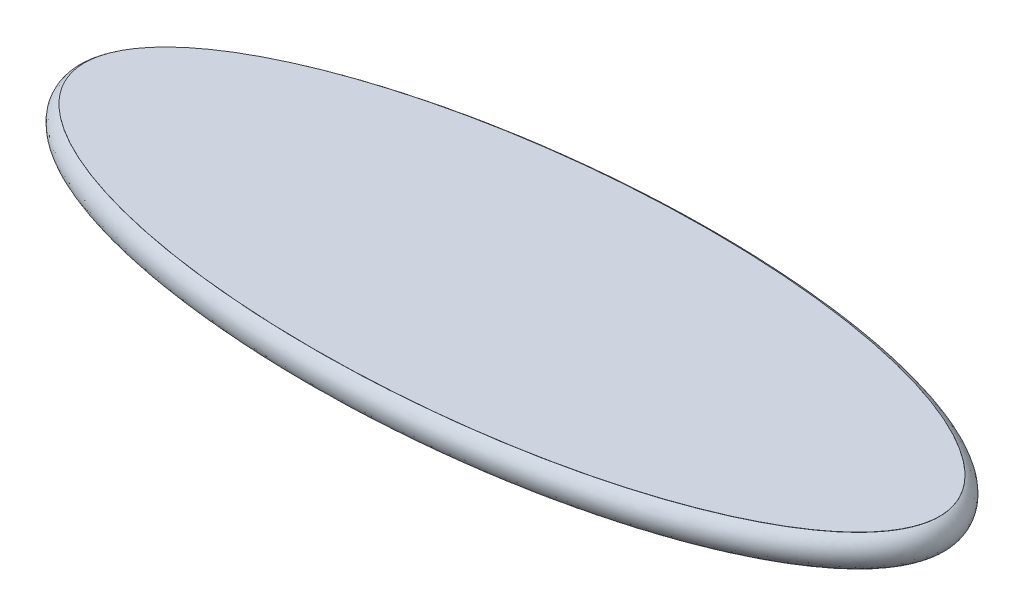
ISO-10303-21;
HEADER;
FILE_DESCRIPTION(('STEP AP214'),'2;1');
FILE_NAME('part.step','',(''),(''),'','','');
FILE_SCHEMA(('AUTOMOTIVE_DESIGN { 1 0 10303 214 1 1 1 1 }'));
ENDSEC;
DATA;
#1=APPLICATION_CONTEXT('core data for automotive mechanical design processes');
#2=APPLICATION_PROTOCOL_DEFINITION('international standard','automotive_design',2000,#1);
#3=PRODUCT_CONTEXT('',#1,'mechanical');
#4=PRODUCT('Part','Part','',(#3));
#5=PRODUCT_RELATED_PRODUCT_CATEGORY('part','',(#4));
#6=PRODUCT_DEFINITION_FORMATION('','',#4);
#7=PRODUCT_DEFINITION_CONTEXT('part definition',#1,'design');
#8=PRODUCT_DEFINITION('design','',#6,#7);
#9=PRODUCT_DEFINITION_SHAPE('','',#8);
#10=(LENGTH_UNIT() NAMED_UNIT(*) SI_UNIT(.MILLI.,.METRE.));
#11=(NAMED_UNIT(*) PLANE_ANGLE_UNIT() SI_UNIT($,.RADIAN.));
#12=(NAMED_UNIT(*) SI_UNIT($,.STERADIAN.) SOLID_ANGLE_UNIT());
#13=UNCERTAINTY_MEASURE_WITH_UNIT(LENGTH_MEASURE(1.E-05),#10,'distance_accuracy_value','');
#14=(GEOMETRIC_REPRESENTATION_CONTEXT(3) GLOBAL_UNCERTAINTY_ASSIGNED_CONTEXT((#13)) GLOBAL_UNIT_ASSIGNED_CONTEXT((#10,
#11,#12)) REPRESENTATION_CONTEXT('',''));
#15=CARTESIAN_POINT('',(0.,0.,0.));
#16=DIRECTION('',(0.,0.,1.));
#17=DIRECTION('',(1.,0.,0.));
#18=AXIS2_PLACEMENT_3D('',#15,#16,#17);
#19=CARTESIAN_POINT('',(0.,2.5,0.));
#20=DIRECTION('',(0.,1.,0.));
#21=DIRECTION('',(0.998798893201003,0.,-0.0489976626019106));
#22=AXIS2_PLACEMENT_3D('',#19,#20,#21);
#23=ELLIPSE('',#22,64.3114986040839,23.3957875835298);
#24=DIRECTION('',(0.,-1.,0.));
#25=VECTOR('',#24,1.);
#26=SURFACE_OF_LINEAR_EXTRUSION('',#23,#25);
#27=CARTESIAN_POINT('',(0.000615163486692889,2.47128683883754,23.4201668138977));
#28=CARTESIAN_POINT('',(-0.941918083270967,2.47130390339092,23.4602750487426));
#29=CARTESIAN_POINT('',(-1.88476717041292,2.4713488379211,23.4928403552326));
#30=CARTESIAN_POINT('',(-3.77088003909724,2.47147954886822,23.5428001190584));
#31=CARTESIAN_POINT('',(-4.71414383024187,2.47156532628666,23.5601942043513));
#32=CARTESIAN_POINT('',(-7.54519905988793,2.47185122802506,23.5894309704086));
#33=CARTESIAN_POINT('',(-9.43331009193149,2.4720798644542,23.5782877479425));
#34=CARTESIAN_POINT('',(-12.2643336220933,2.47234077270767,23.5139885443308));
#35=CARTESIAN_POINT('',(-13.2078569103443,2.47241406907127,23.4846225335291));
#36=CARTESIAN_POINT('',(-15.0942681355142,2.47247444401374,23.409602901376));
#37=CARTESIAN_POINT('',(-16.0371560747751,2.47246152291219,23.3639493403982));
#38=CARTESIAN_POINT('',(-17.9221171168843,2.47235636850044,23.2558462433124));
#39=CARTESIAN_POINT('',(-18.8641900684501,2.47226412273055,23.1933940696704));
#40=CARTESIAN_POINT('',(-20.7470186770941,2.47207976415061,23.0510753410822));
#41=CARTESIAN_POINT('',(-21.6877743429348,2.47198765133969,22.9712089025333));
#42=CARTESIAN_POINT('',(-23.5676483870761,2.47184663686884,22.7933009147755));
#43=CARTESIAN_POINT('',(-24.5067666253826,2.47179773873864,22.6952578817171));
#44=CARTESIAN_POINT('',(-26.3828190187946,2.47176188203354,22.4800911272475));
#45=CARTESIAN_POINT('',(-27.3197531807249,2.47177492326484,22.3629674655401));
#46=CARTESIAN_POINT('',(-29.1914778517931,2.47179053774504,22.1084620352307));
#47=CARTESIAN_POINT('',(-30.1262666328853,2.47179310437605,21.9710675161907));
#48=CARTESIAN_POINT('',(-31.9924517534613,2.4717587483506,21.6747469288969));
#49=CARTESIAN_POINT('',(-32.9238480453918,2.47172182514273,21.5158205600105));
#50=CARTESIAN_POINT('',(-34.7822530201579,2.47164115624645,21.1748587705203));
#51=CARTESIAN_POINT('',(-35.7092624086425,2.47159741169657,20.992827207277));
#52=CARTESIAN_POINT('',(-37.557995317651,2.47153248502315,20.6036843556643));
#53=CARTESIAN_POINT('',(-38.4797190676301,2.47151130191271,20.3965741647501));
#54=CARTESIAN_POINT('',(-40.0007267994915,2.47150767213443,20.0308011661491));
#55=CARTESIAN_POINT('',(-40.6018996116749,2.47151441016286,19.8799681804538));
#56=CARTESIAN_POINT('',(-41.8009207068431,2.47151667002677,19.5656392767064));
#57=CARTESIAN_POINT('',(-42.3987690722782,2.47151219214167,19.4021436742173));
#58=CARTESIAN_POINT('',(-43.5906339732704,2.47146973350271,19.0615294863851));
#59=CARTESIAN_POINT('',(-44.1846501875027,2.47143174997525,18.8844097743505));
#60=CARTESIAN_POINT('',(-45.368104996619,2.4713234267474,18.5154540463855));
#61=CARTESIAN_POINT('',(-45.9575436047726,2.47125308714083,18.3236180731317));
#62=CARTESIAN_POINT('',(-47.1317952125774,2.47110859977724,17.9236543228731));
#63=CARTESIAN_POINT('',(-47.7166006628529,2.47103444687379,17.715504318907));
#64=CARTESIAN_POINT('',(-48.8796873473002,2.4709640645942,17.2815943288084));
#65=CARTESIAN_POINT('',(-49.4579683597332,2.47096783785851,17.0558337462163));
#66=CARTESIAN_POINT('',(-50.6066435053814,2.47101333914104,16.5848445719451));
#67=CARTESIAN_POINT('',(-51.1770367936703,2.47105507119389,16.3396139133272));
#68=CARTESIAN_POINT('',(-52.3080192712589,2.47113779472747,15.8275142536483));
#69=CARTESIAN_POINT('',(-52.8686094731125,2.47117878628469,15.5606475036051));
#70=CARTESIAN_POINT('',(-53.79228169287,2.47122545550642,15.0958266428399));
#71=CARTESIAN_POINT('',(-54.1587737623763,2.47123835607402,14.9046389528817));
#72=CARTESIAN_POINT('',(-54.8853938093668,2.47124679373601,14.510547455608));
#73=CARTESIAN_POINT('',(-55.2455222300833,2.47124233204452,14.307644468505));
#74=CARTESIAN_POINT('',(-55.9578824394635,2.47120926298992,13.8893036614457));
#75=CARTESIAN_POINT('',(-56.3101228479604,2.47118068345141,13.6738805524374));
#76=CARTESIAN_POINT('',(-57.0057047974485,2.4711522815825,13.2291027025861));
#77=CARTESIAN_POINT('',(-57.3490469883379,2.47115245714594,12.9997489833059));
#78=CARTESIAN_POINT('',(-57.9205184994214,2.47119387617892,12.5990493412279));
#79=CARTESIAN_POINT('',(-58.1514485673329,2.47122240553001,12.4316929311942));
#80=CARTESIAN_POINT('',(-58.6074643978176,2.47125555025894,12.0892111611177));
#81=CARTESIAN_POINT('',(-58.8325505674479,2.47126016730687,11.9140863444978));
#82=CARTESIAN_POINT('',(-59.2766233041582,2.47125832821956,11.5550711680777));
#83=CARTESIAN_POINT('',(-59.4955922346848,2.47125184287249,11.3711589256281));
#84=CARTESIAN_POINT('',(-59.9258032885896,2.47125597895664,10.994439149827));
#85=CARTESIAN_POINT('',(-60.1370441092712,2.4712666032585,10.8016301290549));
#86=CARTESIAN_POINT('',(-60.6541622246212,2.47127051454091,10.3076163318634));
#87=CARTESIAN_POINT('',(-60.9544505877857,2.4712524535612,10.0004861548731));
#88=CARTESIAN_POINT('',(-61.5298390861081,2.47124368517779,9.36316114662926));
#89=CARTESIAN_POINT('',(-61.8049304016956,2.4712529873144,9.03295831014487));
#90=CARTESIAN_POINT('',(-62.322483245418,2.47126387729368,8.34932959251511));
#91=CARTESIAN_POINT('',(-62.5650548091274,2.47126549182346,7.99598837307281));
#92=CARTESIAN_POINT('',(-62.8991015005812,2.4712567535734,7.44812583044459));
#93=CARTESIAN_POINT('',(-63.0054510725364,2.47125198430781,7.26259551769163));
#94=CARTESIAN_POINT('',(-63.2072279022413,2.47124842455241,6.88561406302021));
#95=CARTESIAN_POINT('',(-63.3026531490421,2.47124963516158,6.69416183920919));
#96=CARTESIAN_POINT('',(-63.4972967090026,2.47125068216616,6.27120683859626));
#97=CARTESIAN_POINT('',(-63.5941853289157,2.47125023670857,6.03862375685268));
#98=CARTESIAN_POINT('',(-63.7694023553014,2.47124984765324,5.5666307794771));
#99=CARTESIAN_POINT('',(-63.8477371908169,2.4712499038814,5.32722328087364));
#100=CARTESIAN_POINT('',(-63.9842171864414,2.47124619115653,4.84290174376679));
#101=CARTESIAN_POINT('',(-64.0423788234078,2.47124242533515,4.59799237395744));
#102=CARTESIAN_POINT('',(-64.1373278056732,2.47124868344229,4.10403969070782));
#103=CARTESIAN_POINT('',(-64.1741147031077,2.47125870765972,3.85499629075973));
#104=CARTESIAN_POINT('',(-64.2256266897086,2.47127688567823,3.35378562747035));
#105=CARTESIAN_POINT('',(-64.2402774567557,2.47128503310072,3.10161069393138));
#106=CARTESIAN_POINT('',(-64.2471188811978,2.47126796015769,2.59696818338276));
#107=CARTESIAN_POINT('',(-64.2393100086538,2.47124274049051,2.34450061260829));
#108=CARTESIAN_POINT('',(-64.2016926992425,2.47123232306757,1.84107381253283));
#109=CARTESIAN_POINT('',(-64.1718711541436,2.47124714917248,1.59011557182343));
#110=CARTESIAN_POINT('',(-64.0912479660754,2.47125303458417,1.09160100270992));
#111=CARTESIAN_POINT('',(-64.0404438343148,2.47124409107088,0.844045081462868));
#112=CARTESIAN_POINT('',(-63.9060568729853,2.47124363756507,0.30024520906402));
#113=CARTESIAN_POINT('',(-63.8177396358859,2.47125635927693,0.00516925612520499));
#114=CARTESIAN_POINT('',(-63.6151647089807,2.47125932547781,-0.575912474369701));
#115=CARTESIAN_POINT('',(-63.5009009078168,2.47124956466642,-0.861916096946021));
#116=CARTESIAN_POINT('',(-63.2494723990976,2.47124789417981,-1.42415234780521));
#117=CARTESIAN_POINT('',(-63.1122711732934,2.47125601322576,-1.70036853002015));
#118=CARTESIAN_POINT('',(-62.8181559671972,2.47125719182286,-2.24210549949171));
#119=CARTESIAN_POINT('',(-62.661238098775,2.47125024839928,-2.50762416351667));
#120=CARTESIAN_POINT('',(-62.3629379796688,2.47125588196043,-2.97683370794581));
#121=CARTESIAN_POINT('',(-62.2245427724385,2.47126489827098,-3.1824391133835));
#122=CARTESIAN_POINT('',(-61.9381302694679,2.47126348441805,-3.58674208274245));
#123=CARTESIAN_POINT('',(-61.7901150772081,2.47125305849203,-3.78544114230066));
#124=CARTESIAN_POINT('',(-61.3331019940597,2.47124226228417,-4.37180380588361));
#125=CARTESIAN_POINT('',(-61.0112746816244,2.47126240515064,-4.74951980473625));
#126=CARTESIAN_POINT('',(-60.3404368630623,2.4712752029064,-5.48087873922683));
#127=CARTESIAN_POINT('',(-59.9913794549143,2.47126780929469,-5.83447808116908));
#128=CARTESIAN_POINT('',(-59.272112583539,2.47124836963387,-6.51918280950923));
#129=CARTESIAN_POINT('',(-58.9019078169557,2.47123632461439,-6.85029315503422));
#130=CARTESIAN_POINT('',(-58.1338014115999,2.47118858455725,-7.50129758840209));
#131=CARTESIAN_POINT('',(-57.7354138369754,2.47115223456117,-7.82061517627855));
#132=CARTESIAN_POINT('',(-56.9239997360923,2.47115995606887,-8.44001968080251));
#133=CARTESIAN_POINT('',(-56.5109726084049,2.47120403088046,-8.74010580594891));
#134=CARTESIAN_POINT('',(-55.6734560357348,2.47125110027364,-9.32250909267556));
#135=CARTESIAN_POINT('',(-55.2489829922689,2.47125415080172,-9.60484993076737));
#136=CARTESIAN_POINT('',(-54.3900230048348,2.47123706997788,-10.1538257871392));
#137=CARTESIAN_POINT('',(-53.9555359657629,2.4712169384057,-10.4204606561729));
#138=CARTESIAN_POINT('',(-53.1243868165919,2.47116730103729,-10.9120402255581));
#139=CARTESIAN_POINT('',(-52.7285681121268,2.47113900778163,-11.1384160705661));
#140=CARTESIAN_POINT('',(-51.9310440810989,2.47108271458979,-11.5805815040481));
#141=CARTESIAN_POINT('',(-51.5293384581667,2.4710547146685,-11.7963705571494));
#142=CARTESIAN_POINT('',(-50.7207336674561,2.47100971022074,-12.2181440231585));
#143=CARTESIAN_POINT('',(-50.3138336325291,2.47099270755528,-12.4241267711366));
#144=CARTESIAN_POINT('',(-49.4955098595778,2.47098630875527,-12.8269152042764));
#145=CARTESIAN_POINT('',(-49.0840859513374,2.47099691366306,-13.0237205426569));
#146=CARTESIAN_POINT('',(-47.8429584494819,2.4710790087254,-13.6016713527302));
#147=CARTESIAN_POINT('',(-47.0072262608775,2.47120086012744,-13.96992381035));
#148=CARTESIAN_POINT('',(-45.3231563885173,2.47139678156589,-14.6759310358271));
#149=CARTESIAN_POINT('',(-44.4748197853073,2.47147085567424,-15.0136884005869));
#150=CARTESIAN_POINT('',(-42.771047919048,2.47154640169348,-15.6606241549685));
#151=CARTESIAN_POINT('',(-41.9156520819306,2.47154814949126,-15.969906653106));
#152=CARTESIAN_POINT('',(-40.1963559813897,2.4715449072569,-16.5638138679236));
#153=CARTESIAN_POINT('',(-39.3324555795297,2.47153991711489,-16.8484381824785));
#154=CARTESIAN_POINT('',(-37.5980402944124,2.47156906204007,-17.3948783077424));
#155=CARTESIAN_POINT('',(-36.7275295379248,2.47160317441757,-17.6567072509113));
#156=CARTESIAN_POINT('',(-34.9804935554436,2.47168646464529,-18.1593895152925));
#157=CARTESIAN_POINT('',(-34.1039683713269,2.47173564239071,-18.400242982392));
#158=CARTESIAN_POINT('',(-32.3463728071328,2.47182259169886,-18.8621842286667));
#159=CARTESIAN_POINT('',(-31.4653059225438,2.47186037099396,-19.0832853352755));
#160=CARTESIAN_POINT('',(-29.6987543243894,2.47188767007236,-19.5070386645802));
#161=CARTESIAN_POINT('',(-28.8132696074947,2.47187718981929,-19.7096908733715));
#162=CARTESIAN_POINT('',(-27.0383819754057,2.47185495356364,-20.097513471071));
#163=CARTESIAN_POINT('',(-26.1489786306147,2.47184319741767,-20.2826818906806));
#164=CARTESIAN_POINT('',(-24.3668609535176,2.47186732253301,-20.6363001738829));
#165=CARTESIAN_POINT('',(-23.4741466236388,2.47190320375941,-20.8047500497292));
#166=CARTESIAN_POINT('',(-21.6861692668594,2.47200580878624,-21.1255315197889));
#167=CARTESIAN_POINT('',(-20.7909073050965,2.4720725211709,-21.2778690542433));
#168=CARTESIAN_POINT('',(-18.997877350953,2.47220718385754,-21.5670380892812));
#169=CARTESIAN_POINT('',(-18.1001093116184,2.47227513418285,-21.7038692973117));
#170=CARTESIAN_POINT('',(-15.4036756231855,2.47236301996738,-22.0917789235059));
#171=CARTESIAN_POINT('',(-13.6017196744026,2.47226702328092,-22.3203019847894));
#172=CARTESIAN_POINT('',(-9.99168800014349,2.47194803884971,-22.7197351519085));
#173=CARTESIAN_POINT('',(-8.1836129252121,2.47172506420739,-22.8906511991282));
#174=CARTESIAN_POINT('',(-4.56299948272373,2.47139166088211,-23.1762985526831));
#175=CARTESIAN_POINT('',(-2.7504610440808,2.47128123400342,-23.2910289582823));
#176=CARTESIAN_POINT('',(0.877274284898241,2.47127954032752,-23.4646735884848));
#177=CARTESIAN_POINT('',(2.6924711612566,2.47138827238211,-23.5235881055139));
#178=CARTESIAN_POINT('',(6.32378671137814,2.47171235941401,-23.5849825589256));
#179=CARTESIAN_POINT('',(8.13990535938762,2.47192771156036,-23.5874639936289));
#180=CARTESIAN_POINT('',(11.7714012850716,2.47231190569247,-23.5343291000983));
#181=CARTESIAN_POINT('',(13.5867785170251,2.47248074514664,-23.478709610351));
#182=CARTESIAN_POINT('',(17.2149046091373,2.47244663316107,-23.3065154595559));
#183=CARTESIAN_POINT('',(19.0276532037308,2.47224364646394,-23.1899350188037));
#184=CARTESIAN_POINT('',(21.7430093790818,2.47198624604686,-22.9660447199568));
#185=CARTESIAN_POINT('',(22.6476834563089,2.47190828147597,-22.8832229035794));
#186=CARTESIAN_POINT('',(24.4553197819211,2.47180193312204,-22.7004928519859));
#187=CARTESIAN_POINT('',(25.3582820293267,2.47177354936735,-22.6005846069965));
#188=CARTESIAN_POINT('',(27.1617742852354,2.47176521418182,-22.3828626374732));
#189=CARTESIAN_POINT('',(28.0623049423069,2.47178524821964,-22.2650542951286));
#190=CARTESIAN_POINT('',(29.8606919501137,2.47179543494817,-22.0104814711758));
#191=CARTESIAN_POINT('',(30.7585483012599,2.47178558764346,-21.873716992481));
#192=CARTESIAN_POINT('',(32.5511868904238,2.4717377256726,-21.5799645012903));
#193=CARTESIAN_POINT('',(33.4459683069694,2.47169970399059,-21.422971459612));
#194=CARTESIAN_POINT('',(35.231474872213,2.47162097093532,-21.0873036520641));
#195=CARTESIAN_POINT('',(36.1222000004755,2.47158025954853,-20.9086287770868));
#196=CARTESIAN_POINT('',(37.8997377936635,2.47152416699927,-20.5275629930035));
#197=CARTESIAN_POINT('',(38.7865442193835,2.47150881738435,-20.3251428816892));
#198=CARTESIAN_POINT('',(40.5539136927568,2.47150863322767,-19.8945618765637));
#199=CARTESIAN_POINT('',(41.4344767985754,2.47152379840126,-19.6664012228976));
#200=CARTESIAN_POINT('',(43.0112451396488,2.47149685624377,-19.2304112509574));
#201=CARTESIAN_POINT('',(43.7088752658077,2.47146566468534,-19.0277365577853));
#202=CARTESIAN_POINT('',(45.0981269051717,2.47135361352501,-18.6025019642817));
#203=CARTESIAN_POINT('',(45.7897479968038,2.47127275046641,-18.3799406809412));
#204=CARTESIAN_POINT('',(47.1657811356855,2.47110529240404,-17.9128324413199));
#205=CARTESIAN_POINT('',(47.8501909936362,2.47101869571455,-17.6682790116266));
#206=CARTESIAN_POINT('',(49.2085339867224,2.47095497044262,-17.1552341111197));
#207=CARTESIAN_POINT('',(49.8824846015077,2.47097763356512,-16.8867891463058));
#208=CARTESIAN_POINT('',(51.2187228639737,2.47105448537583,-16.3225779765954));
#209=CARTESIAN_POINT('',(51.8810131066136,2.47110866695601,-16.0268179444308));
#210=CARTESIAN_POINT('',(53.1905716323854,2.47119776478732,-15.4042856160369));
#211=CARTESIAN_POINT('',(53.837847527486,2.47123269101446,-15.0775294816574));
#212=CARTESIAN_POINT('',(54.9110521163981,2.47124833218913,-14.4973593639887));
#213=CARTESIAN_POINT('',(55.3421476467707,2.47124271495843,-14.2535002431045));
#214=CARTESIAN_POINT('',(56.1933412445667,2.47119330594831,-13.7471754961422));
#215=CARTESIAN_POINT('',(56.6134391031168,2.47114951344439,-13.484709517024));
#216=CARTESIAN_POINT('',(57.4404045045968,2.47115571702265,-12.9388121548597));
#217=CARTESIAN_POINT('',(57.8472594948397,2.47120579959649,-12.6553616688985));
#218=CARTESIAN_POINT('',(58.6438485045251,2.47125126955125,-12.0652887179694));
#219=CARTESIAN_POINT('',(59.0335848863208,2.47124666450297,-11.7586694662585));
#220=CARTESIAN_POINT('',(59.733022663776,2.47125798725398,-11.1686880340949));
#221=CARTESIAN_POINT('',(60.0458138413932,2.4712708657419,-10.8890028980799));
#222=CARTESIAN_POINT('',(60.6521603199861,2.47126550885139,-10.3093063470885));
#223=CARTESIAN_POINT('',(60.9457126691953,2.47124726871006,-10.0092918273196));
#224=CARTESIAN_POINT('',(61.5081938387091,2.47124850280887,-9.38796228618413));
#225=CARTESIAN_POINT('',(61.7771762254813,2.47126789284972,-9.06669636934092));
#226=CARTESIAN_POINT('',(62.1580257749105,2.4712557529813,-8.56774947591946));
#227=CARTESIAN_POINT('',(62.2811811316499,2.47124484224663,-8.39863033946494));
#228=CARTESIAN_POINT('',(62.5191531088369,2.47124512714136,-8.05455270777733));
#229=CARTESIAN_POINT('',(62.6339679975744,2.47125632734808,-7.87959301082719));
#230=CARTESIAN_POINT('',(62.8848577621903,2.47126102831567,-7.47451644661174));
#231=CARTESIAN_POINT('',(63.0179930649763,2.47124875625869,-7.24256423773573));
#232=CARTESIAN_POINT('',(63.2669014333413,2.47124684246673,-6.76958234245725));
#233=CARTESIAN_POINT('',(63.3826801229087,2.47125719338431,-6.52855562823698));
#234=CARTESIAN_POINT('',(63.5946552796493,2.47125444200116,-6.0382367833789));
#235=CARTESIAN_POINT('',(63.6908684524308,2.47124135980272,-5.78895191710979));
#236=CARTESIAN_POINT('',(63.8617436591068,2.47124037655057,-5.28306099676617));
#237=CARTESIAN_POINT('',(63.9364056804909,2.47125247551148,-5.02645493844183));
#238=CARTESIAN_POINT('',(64.0629122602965,2.4712539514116,-4.50536668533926));
#239=CARTESIAN_POINT('',(64.1145605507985,2.47124313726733,-4.24083653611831));
#240=CARTESIAN_POINT('',(64.1928218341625,2.47125533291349,-3.70808339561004));
#241=CARTESIAN_POINT('',(64.2194351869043,2.47127834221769,-3.43986045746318));
#242=CARTESIAN_POINT('',(64.2470764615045,2.47128225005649,-2.9020966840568));
#243=CARTESIAN_POINT('',(64.2481039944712,2.47126314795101,-2.63255582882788));
#244=CARTESIAN_POINT('',(64.2248463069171,2.47124171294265,-2.09458699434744));
#245=CARTESIAN_POINT('',(64.2005618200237,2.47123937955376,-1.82615898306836));
#246=CARTESIAN_POINT('',(64.1314204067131,2.47124261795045,-1.31961907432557));
#247=CARTESIAN_POINT('',(64.0888893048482,2.47124741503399,-1.08118374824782));
#248=CARTESIAN_POINT('',(63.985413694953,2.47125247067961,-0.608388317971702));
#249=CARTESIAN_POINT('',(63.9244709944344,2.47125272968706,-0.374027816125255));
#250=CARTESIAN_POINT('',(63.7855922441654,2.47125246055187,0.0895928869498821));
#251=CARTESIAN_POINT('',(63.7076549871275,2.4712519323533,0.318852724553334));
#252=CARTESIAN_POINT('',(63.5363077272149,2.47125183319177,0.771599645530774));
#253=CARTESIAN_POINT('',(63.4428899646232,2.47125226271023,0.995083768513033));
#254=CARTESIAN_POINT('',(63.1805816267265,2.47124958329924,1.57086924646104));
#255=CARTESIAN_POINT('',(63.000539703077,2.47124414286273,1.91812004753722));
#256=CARTESIAN_POINT('',(62.6104935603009,2.47125208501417,2.59522044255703));
#257=CARTESIAN_POINT('',(62.400482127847,2.47126547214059,2.92506582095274));
#258=CARTESIAN_POINT('',(61.9551787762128,2.47126404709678,3.56851768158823));
#259=CARTESIAN_POINT('',(61.7198160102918,2.47124915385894,3.88207482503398));
#260=CARTESIAN_POINT('',(61.2287566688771,2.47124940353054,4.49266279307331));
#261=CARTESIAN_POINT('',(60.9730621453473,2.47126454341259,4.78969528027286));
#262=CARTESIAN_POINT('',(60.381994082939,2.4712747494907,5.43721674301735));
#263=CARTESIAN_POINT('',(60.0421395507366,2.47126418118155,5.7836052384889));
#264=CARTESIAN_POINT('',(59.3416890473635,2.47124947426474,6.45509886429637));
#265=CARTESIAN_POINT('',(58.9810776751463,2.47124534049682,6.78018779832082));
#266=CARTESIAN_POINT('',(58.2431498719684,2.47119719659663,7.41098100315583));
#267=CARTESIAN_POINT('',(57.8658279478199,2.47115317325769,7.71667881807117));
#268=CARTESIAN_POINT('',(57.0969445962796,2.47114989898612,8.31094667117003));
#269=CARTESIAN_POINT('',(56.7053596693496,2.4711907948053,8.59948617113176));
#270=CARTESIAN_POINT('',(55.9110726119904,2.47124158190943,9.16039606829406));
#271=CARTESIAN_POINT('',(55.5083754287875,2.47125148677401,9.43277349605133));
#272=CARTESIAN_POINT('',(54.6935416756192,2.47124668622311,9.96292052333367));
#273=CARTESIAN_POINT('',(54.2814057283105,2.47123198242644,10.22069108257));
#274=CARTESIAN_POINT('',(53.505794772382,2.47119155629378,10.6886852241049));
#275=CARTESIAN_POINT('',(53.1433383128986,2.47116760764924,10.9006026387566));
#276=CARTESIAN_POINT('',(52.4131670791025,2.47111720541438,11.3151904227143));
#277=CARTESIAN_POINT('',(52.0454520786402,2.47109075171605,11.5178603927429));
#278=CARTESIAN_POINT('',(50.9353339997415,2.47101588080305,12.1129813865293));
#279=CARTESIAN_POINT('',(50.1859859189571,2.47097195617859,12.4925267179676));
#280=CARTESIAN_POINT('',(48.6738952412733,2.47101056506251,13.2208066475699));
#281=CARTESIAN_POINT('',(47.9111732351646,2.471092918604,13.5695843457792));
#282=CARTESIAN_POINT('',(46.3740726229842,2.47127155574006,14.2402322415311));
#283=CARTESIAN_POINT('',(45.5996946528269,2.47136783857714,14.5621039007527));
#284=CARTESIAN_POINT('',(44.04334657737,2.47149733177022,15.1808180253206));
#285=CARTESIAN_POINT('',(43.2614011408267,2.47153070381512,15.47772277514));
#286=CARTESIAN_POINT('',(41.6895362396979,2.47155373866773,16.0495758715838));
#287=CARTESIAN_POINT('',(40.8996167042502,2.47154340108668,16.3245240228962));
#288=CARTESIAN_POINT('',(39.3129114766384,2.47154130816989,16.8542747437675));
#289=CARTESIAN_POINT('',(38.5161245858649,2.47154955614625,17.1090737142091));
#290=CARTESIAN_POINT('',(36.9168173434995,2.47159441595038,17.5999376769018));
#291=CARTESIAN_POINT('',(36.1142970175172,2.47163102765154,17.8360027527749));
#292=CARTESIAN_POINT('',(34.5050595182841,2.47171232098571,18.2904185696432));
#293=CARTESIAN_POINT('',(33.6983468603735,2.47175699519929,18.5087853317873));
#294=CARTESIAN_POINT('',(32.0806568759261,2.47183329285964,18.929072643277));
#295=CARTESIAN_POINT('',(31.2696795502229,2.47186491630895,19.1309931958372));
#296=CARTESIAN_POINT('',(29.6440889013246,2.47188747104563,19.5192393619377));
#297=CARTESIAN_POINT('',(28.8294759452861,2.47187840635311,19.7055665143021));
#298=CARTESIAN_POINT('',(27.1969911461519,2.47185648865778,20.0633803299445));
#299=CARTESIAN_POINT('',(26.3791192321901,2.47184363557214,20.2348666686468));
#300=CARTESIAN_POINT('',(23.9217224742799,2.47186769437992,20.7279244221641));
#301=CARTESIAN_POINT('',(22.2778903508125,2.47196717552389,21.0282192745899));
#302=CARTESIAN_POINT('',(18.9815217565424,2.47220413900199,21.5759291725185));
#303=CARTESIAN_POINT('',(17.3289853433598,2.47234162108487,21.8233445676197));
#304=CARTESIAN_POINT('',(14.3746048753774,2.47232475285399,22.2199834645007));
#305=CARTESIAN_POINT('',(13.0740478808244,2.47222698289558,22.3788745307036));
#306=CARTESIAN_POINT('',(10.4696225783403,2.47198345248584,22.6666622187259));
#307=CARTESIAN_POINT('',(9.16575428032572,2.47183769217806,22.7955589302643));
#308=CARTESIAN_POINT('',(6.55271862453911,2.47156910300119,23.0241794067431));
#309=CARTESIAN_POINT('',(5.24354588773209,2.47144632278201,23.1238415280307));
#310=CARTESIAN_POINT('',(2.623324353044,2.47129331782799,23.2939269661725));
#311=CARTESIAN_POINT('',(1.31227559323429,2.47126309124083,23.3643508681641));
#312=CARTESIAN_POINT('',(0.000615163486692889,2.47128683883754,23.4201668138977));
#313=B_SPLINE_CURVE_WITH_KNOTS('',3,(#27,#28,#29,#30,#31,#32,#33,#34,#35,#36,#37,#38,#39,#40,
#41,#42,#43,#44,#45,#46,#47,#48,#49,#50,#51,#52,#53,#54,#55,#56,#57,#58,#59,#60,#61,#62,#63,#64,
#65,#66,#67,#68,#69,#70,#71,#72,#73,#74,#75,#76,#77,#78,#79,#80,#81,#82,#83,#84,#85,#86,#87,#88,
#89,#90,#91,#92,#93,#94,#95,#96,#97,#98,#99,#100,#101,#102,#103,#104,#105,#106,#107,#108,#109,
#110,#111,#112,#113,#114,#115,#116,#117,#118,#119,#120,#121,#122,#123,#124,#125,#126,#127,#128,
#129,#130,#131,#132,#133,#134,#135,#136,#137,#138,#139,#140,#141,#142,#143,#144,#145,#146,#147,
#148,#149,#150,#151,#152,#153,#154,#155,#156,#157,#158,#159,#160,#161,#162,#163,#164,#165,#166,
#167,#168,#169,#170,#171,#172,#173,#174,#175,#176,#177,#178,#179,#180,#181,#182,#183,#184,#185,
#186,#187,#188,#189,#190,#191,#192,#193,#194,#195,#196,#197,#198,#199,#200,#201,#202,#203,#204,
#205,#206,#207,#208,#209,#210,#211,#212,#213,#214,#215,#216,#217,#218,#219,#220,#221,#222,#223,
#224,#225,#226,#227,#228,#229,#230,#231,#232,#233,#234,#235,#236,#237,#238,#239,#240,#241,#242,
#243,#244,#245,#246,#247,#248,#249,#250,#251,#252,#253,#254,#255,#256,#257,#258,#259,#260,#261,
#262,#263,#264,#265,#266,#267,#268,#269,#270,#271,#272,#273,#274,#275,#276,#277,#278,#279,#280,
#281,#282,#283,#284,#285,#286,#287,#288,#289,#290,#291,#292,#293,#294,#295,#296,#297,#298,#299,
#300,#301,#302,#303,#304,#305,#306,#307,#308,#309,#310,#311,#312),.UNSPECIFIED.,.T.,.F.,(4,2,2,
2,2,2,2,2,2,2,2,2,2,2,2,2,2,2,2,2,2,2,2,2,2,2,2,2,2,2,2,2,2,2,2,2,2,2,2,2,2,2,2,2,2,2,2,2,2,2,2,
2,2,2,2,2,2,2,2,2,2,2,2,2,2,2,2,2,2,2,2,2,2,2,2,2,2,2,2,2,2,2,2,2,2,2,2,2,2,2,2,2,2,2,2,2,2,2,2,
2,2,2,2,2,2,2,2,2,2,2,2,2,2,2,2,2,2,2,2,2,2,2,2,2,2,2,2,2,2,2,2,2,2,2,2,2,2,2,2,2,2,2,4),(0.,
2.83011247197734,5.66029434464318,11.3234922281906,14.1553271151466,16.9871515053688,
19.819420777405,22.6516711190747,25.4841527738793,28.3166255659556,31.1508876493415,
33.985189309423,36.819018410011,39.6527235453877,41.5120220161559,43.3712741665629,
45.2306802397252,47.0900809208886,48.9520605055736,50.814103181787,52.6763437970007,
54.5383909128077,55.7782988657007,57.0181201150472,58.2565129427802,59.4948150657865,
60.350260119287,61.2056454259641,62.0632848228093,62.9210681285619,64.2084553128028,
65.4962914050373,66.779653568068,67.4209017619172,68.0622678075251,68.8174010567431,
69.5722722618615,70.3265254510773,71.0807944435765,71.8375903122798,72.5943703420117,
73.3516013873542,74.1089222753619,75.0315579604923,75.954411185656,76.8787479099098,
77.8032672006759,78.5465029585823,79.2895767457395,80.7764832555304,82.2660099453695,
83.7552071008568,85.286244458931,86.8173447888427,88.3463568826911,89.8753835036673,
91.243155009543,92.6109956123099,93.9790676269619,95.3471912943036,98.0862301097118,
100.825035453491,103.553392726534,106.281794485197,109.008613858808,111.735414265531,
114.460360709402,117.185309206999,119.910564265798,122.635817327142,125.360062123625,
128.084358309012,133.532461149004,138.98000191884,144.427630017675,149.875229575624,
155.322684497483,160.770435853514,166.218703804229,168.943943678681,171.669185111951,
174.393608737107,177.118031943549,179.843133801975,182.568249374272,185.29675217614,
188.025229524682,190.204393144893,192.383708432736,194.563667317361,196.73947193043,
198.914786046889,201.088972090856,202.574446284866,204.059948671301,205.546820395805,
207.033486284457,208.291480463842,209.54966720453,210.805041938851,211.432462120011,
212.060012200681,212.861674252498,213.663075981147,214.463790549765,215.264505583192,
216.071924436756,216.879331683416,217.686751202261,218.494147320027,219.219987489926,
219.945756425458,220.671576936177,221.397762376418,222.569285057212,223.741090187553,
224.916259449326,226.091310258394,227.545996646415,229.001776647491,230.458038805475,
231.916819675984,233.374961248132,234.833006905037,236.092446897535,237.351941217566,
239.871027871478,242.38652775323,244.901890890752,247.410780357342,249.91969213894,
252.429051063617,254.938398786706,257.445448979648,259.952498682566,262.459300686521,
264.966157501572,269.978249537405,274.990308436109,278.92064828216,282.850976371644,
286.789533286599,290.728011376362),.UNSPECIFIED.);
#314=CARTESIAN_POINT('',(0.000615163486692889,2.47128683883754,23.4201668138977));
#315=VERTEX_POINT('',#314);
#316=EDGE_CURVE('E11',#315,#315,#313,.T.);
#317=ORIENTED_EDGE('',*,*,#316,.F.);
#318=EDGE_LOOP('',(#317));
#319=FACE_BOUND('',#318,.T.);
#320=CARTESIAN_POINT('',(64.2342536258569,2.5,-3.15111311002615));
#321=VERTEX_POINT('',#320);
#322=EDGE_CURVE('E65',#321,#321,#23,.T.);
#323=ORIENTED_EDGE('',*,*,#322,.F.);
#324=EDGE_LOOP('',(#323));
#325=FACE_BOUND('',#324,.T.);
#326=ADVANCED_FACE('F49',(#319,#325),#26,.F.);
#327=CARTESIAN_POINT('',(0.,2.5,0.));
#328=DIRECTION('',(0.,1.,0.));
#329=DIRECTION('',(0.,0.,1.));
#330=AXIS2_PLACEMENT_3D('',#327,#328,#329);
#331=PLANE('',#330);
#332=ORIENTED_EDGE('',*,*,#322,.T.);
#333=EDGE_LOOP('',(#332));
#334=FACE_BOUND('',#333,.T.);
#335=ADVANCED_FACE('F85',(#334),#331,.T.);
#336=CARTESIAN_POINT('',(0.000615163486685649,2.5,23.367672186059));
#337=CARTESIAN_POINT('',(0.381409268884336,2.5,23.3514523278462));
#338=CARTESIAN_POINT('',(0.763296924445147,2.5,23.3339606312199));
#339=CARTESIAN_POINT('',(6.21857759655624,2.5,23.0662753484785));
#340=CARTESIAN_POINT('',(16.328557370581,2.5,22.119057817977));
#341=CARTESIAN_POINT('',(29.7457692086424,2.5,19.648568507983));
#342=CARTESIAN_POINT('',(40.8245353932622,2.5,16.4832633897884));
#343=CARTESIAN_POINT('',(49.2151898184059,2.5,13.081557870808));
#344=CARTESIAN_POINT('',(54.5184496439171,2.5,10.1218926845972));
#345=CARTESIAN_POINT('',(57.8614893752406,2.5,7.71614574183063));
#346=CARTESIAN_POINT('',(59.9849371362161,2.5,5.82930987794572));
#347=CARTESIAN_POINT('',(61.5686707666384,2.5,4.05838352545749));
#348=CARTESIAN_POINT('',(62.7049189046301,2.5,2.40822881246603));
#349=CARTESIAN_POINT('',(63.4741137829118,2.5,0.878476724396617));
#350=CARTESIAN_POINT('',(63.9449551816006,2.5,-0.534803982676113));
#351=CARTESIAN_POINT('',(64.1751658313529,2.5,-1.83774968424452));
#352=CARTESIAN_POINT('',(64.2015766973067,2.5,-2.6838670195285));
#353=CARTESIAN_POINT('',(64.1838499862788,2.5,-3.10814686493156));
#354=CARTESIAN_POINT('',(64.1651225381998,2.5,-3.48777548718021));
#355=CARTESIAN_POINT('',(64.0854910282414,2.5,-4.22890417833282));
#356=CARTESIAN_POINT('',(63.7888525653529,2.5,-5.43731835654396));
#357=CARTESIAN_POINT('',(63.2422096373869,2.5,-6.77798876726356));
#358=CARTESIAN_POINT('',(62.4012354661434,2.5,-8.20541996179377));
#359=CARTESIAN_POINT('',(61.1996744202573,2.5,-9.71768960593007));
#360=CARTESIAN_POINT('',(59.5600178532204,2.5,-11.3085042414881));
#361=CARTESIAN_POINT('',(57.3934059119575,2.5,-12.9656145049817));
#362=CARTESIAN_POINT('',(54.0183288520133,2.5,-15.0240202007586));
#363=CARTESIAN_POINT('',(48.714343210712,2.5,-17.4566601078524));
#364=CARTESIAN_POINT('',(40.3851237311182,2.5,-20.0631235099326));
#365=CARTESIAN_POINT('',(29.4287319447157,2.5,-22.2206424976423));
#366=CARTESIAN_POINT('',(15.8390842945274,2.5,-23.5444382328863));
#367=CARTESIAN_POINT('',(5.06221161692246,2.5,-23.6007878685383));
#368=CARTESIAN_POINT('',(-0.763296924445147,2.5,-23.3339606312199));
#369=CARTESIAN_POINT('',(-6.21857759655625,2.5,-23.0662753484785));
#370=CARTESIAN_POINT('',(-16.328557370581,2.5,-22.119057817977));
#371=CARTESIAN_POINT('',(-29.7457692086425,2.5,-19.648568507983));
#372=CARTESIAN_POINT('',(-40.8245353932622,2.5,-16.4832633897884));
#373=CARTESIAN_POINT('',(-49.215189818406,2.5,-13.081557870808));
#374=CARTESIAN_POINT('',(-54.5184496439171,2.5,-10.1218926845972));
#375=CARTESIAN_POINT('',(-57.8614893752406,2.5,-7.71614574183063));
#376=CARTESIAN_POINT('',(-59.9849371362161,2.5,-5.82930987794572));
#377=CARTESIAN_POINT('',(-61.5686707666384,2.5,-4.05838352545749));
#378=CARTESIAN_POINT('',(-62.7049189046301,2.5,-2.40822881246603));
#379=CARTESIAN_POINT('',(-63.4741137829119,2.5,-0.878476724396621));
#380=CARTESIAN_POINT('',(-63.9449551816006,2.5,0.534803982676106));
#381=CARTESIAN_POINT('',(-64.1751658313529,2.5,1.83774968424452));
#382=CARTESIAN_POINT('',(-64.2015766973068,2.5,2.68386701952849));
#383=CARTESIAN_POINT('',(-64.1838499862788,2.5,3.10814686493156));
#384=CARTESIAN_POINT('',(-64.1651225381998,2.5,3.48777548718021));
#385=CARTESIAN_POINT('',(-64.0854910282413,2.5,4.22890417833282));
#386=CARTESIAN_POINT('',(-63.7888525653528,2.5,5.43731835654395));
#387=CARTESIAN_POINT('',(-63.2422096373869,2.5,6.77798876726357));
#388=CARTESIAN_POINT('',(-62.4012354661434,2.5,8.20541996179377));
#389=CARTESIAN_POINT('',(-61.1996744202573,2.5,9.71768960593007));
#390=CARTESIAN_POINT('',(-59.5600178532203,2.5,11.3085042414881));
#391=CARTESIAN_POINT('',(-57.3934059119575,2.5,12.9656145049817));
#392=CARTESIAN_POINT('',(-54.0183288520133,2.5,15.0240202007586));
#393=CARTESIAN_POINT('',(-48.7143432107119,2.5,17.4566601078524));
#394=CARTESIAN_POINT('',(-40.3851237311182,2.5,20.0631235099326));
#395=CARTESIAN_POINT('',(-29.4287319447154,2.5,22.2206424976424));
#396=CARTESIAN_POINT('',(-15.839084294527,2.5,23.5444382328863));
#397=CARTESIAN_POINT('',(-5.42741770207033,2.5,23.5988782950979));
#398=CARTESIAN_POINT('',(0.000615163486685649,2.5,23.367672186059));
#399=CARTESIAN_POINT('',(0.000615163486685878,1.28787878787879,25.6403994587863));
#400=CARTESIAN_POINT('',(0.386261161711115,1.28787878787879,25.6241787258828));
#401=CARTESIAN_POINT('',(0.773001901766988,1.28787878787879,25.6066705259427));
#402=CARTESIAN_POINT('',(6.29747510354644,1.28787878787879,25.3385275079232));
#403=CARTESIAN_POINT('',(16.5413489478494,1.28787878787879,24.3847355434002));
#404=CARTESIAN_POINT('',(30.1599971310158,1.28787878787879,21.8866425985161));
#405=CARTESIAN_POINT('',(41.4590016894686,1.28787878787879,18.6699885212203));
#406=CARTESIAN_POINT('',(50.0921390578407,1.28787878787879,15.1843198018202));
#407=CARTESIAN_POINT('',(55.6332791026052,1.28787878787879,12.1086974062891));
#408=CARTESIAN_POINT('',(59.1973820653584,1.28787878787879,9.5596916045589));
#409=CARTESIAN_POINT('',(61.5126581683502,1.28787878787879,7.51864111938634));
#410=CARTESIAN_POINT('',(63.2891382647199,1.28787878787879,5.55266226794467));
#411=CARTESIAN_POINT('',(64.6081884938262,1.28787878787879,3.66340348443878));
#412=CARTESIAN_POINT('',(65.5361775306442,1.28787878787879,1.85285807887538));
#413=CARTESIAN_POINT('',(66.1276595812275,1.28787878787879,0.127752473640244));
#414=CARTESIAN_POINT('',(66.4309340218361,1.28787878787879,-1.5021600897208));
#415=CARTESIAN_POINT('',(66.4741367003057,1.28787878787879,-2.57147554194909));
#416=CARTESIAN_POINT('',(66.4566217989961,1.28787878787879,-3.11180080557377));
#417=CARTESIAN_POINT('',(66.4372888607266,1.28787878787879,-3.595681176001));
#418=CARTESIAN_POINT('',(66.3446308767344,1.28787878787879,-4.53237779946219));
#419=CARTESIAN_POINT('',(65.9844653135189,1.28787878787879,-6.05592428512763));
#420=CARTESIAN_POINT('',(65.3231687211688,1.28787878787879,-7.71156800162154));
#421=CARTESIAN_POINT('',(64.3270896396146,1.28787878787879,-9.4260812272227));
#422=CARTESIAN_POINT('',(62.9436045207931,1.28787878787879,-11.1849107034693));
#423=CARTESIAN_POINT('',(61.1097026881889,1.28787878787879,-12.9780447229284));
#424=CARTESIAN_POINT('',(58.7482306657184,1.28787878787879,-14.7955517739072));
#425=CARTESIAN_POINT('',(55.1476040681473,1.28787878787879,-17.0029841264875));
#426=CARTESIAN_POINT('',(49.6003875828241,1.28787878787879,-19.5558968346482));
#427=CARTESIAN_POINT('',(41.0237292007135,1.28787878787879,-22.2487990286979));
#428=CARTESIAN_POINT('',(29.8438462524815,1.28787878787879,-24.4586468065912));
#429=CARTESIAN_POINT('',(16.0460840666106,1.28787878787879,-25.8108517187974));
#430=CARTESIAN_POINT('',(5.12653805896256,1.28787878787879,-25.8737495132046));
#431=CARTESIAN_POINT('',(-0.77300190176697,1.28787878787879,-25.6066705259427));
#432=CARTESIAN_POINT('',(-6.29747510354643,1.28787878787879,-25.3385275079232));
#433=CARTESIAN_POINT('',(-16.5413489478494,1.28787878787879,-24.3847355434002));
#434=CARTESIAN_POINT('',(-30.1599971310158,1.28787878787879,-21.8866425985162));
#435=CARTESIAN_POINT('',(-41.4590016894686,1.28787878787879,-18.6699885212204));
#436=CARTESIAN_POINT('',(-50.0921390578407,1.28787878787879,-15.1843198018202));
#437=CARTESIAN_POINT('',(-55.6332791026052,1.28787878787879,-12.1086974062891));
#438=CARTESIAN_POINT('',(-59.1973820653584,1.28787878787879,-9.55969160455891));
#439=CARTESIAN_POINT('',(-61.5126581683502,1.28787878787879,-7.51864111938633));
#440=CARTESIAN_POINT('',(-63.2891382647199,1.28787878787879,-5.55266226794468));
#441=CARTESIAN_POINT('',(-64.6081884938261,1.28787878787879,-3.66340348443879));
#442=CARTESIAN_POINT('',(-65.5361775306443,1.28787878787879,-1.85285807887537));
#443=CARTESIAN_POINT('',(-66.1276595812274,1.28787878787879,-0.127752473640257));
#444=CARTESIAN_POINT('',(-66.4309340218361,1.28787878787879,1.50216008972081));
#445=CARTESIAN_POINT('',(-66.4741367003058,1.28787878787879,2.57147554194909));
#446=CARTESIAN_POINT('',(-66.4566217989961,1.28787878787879,3.11180080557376));
#447=CARTESIAN_POINT('',(-66.4372888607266,1.28787878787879,3.595681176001));
#448=CARTESIAN_POINT('',(-66.3446308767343,1.28787878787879,4.5323777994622));
#449=CARTESIAN_POINT('',(-65.9844653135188,1.28787878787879,6.05592428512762));
#450=CARTESIAN_POINT('',(-65.3231687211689,1.28787878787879,7.71156800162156));
#451=CARTESIAN_POINT('',(-64.3270896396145,1.28787878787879,9.42608122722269));
#452=CARTESIAN_POINT('',(-62.943604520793,1.28787878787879,11.1849107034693));
#453=CARTESIAN_POINT('',(-61.1097026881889,1.28787878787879,12.9780447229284));
#454=CARTESIAN_POINT('',(-58.7482306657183,1.28787878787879,14.7955517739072));
#455=CARTESIAN_POINT('',(-55.1476040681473,1.28787878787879,17.0029841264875));
#456=CARTESIAN_POINT('',(-49.600387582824,1.28787878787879,19.5558968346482));
#457=CARTESIAN_POINT('',(-41.0237292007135,1.28787878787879,22.2487990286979));
#458=CARTESIAN_POINT('',(-29.8438462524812,1.28787878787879,24.4586468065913));
#459=CARTESIAN_POINT('',(-16.0460840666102,1.28787878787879,25.8108517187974));
#460=CARTESIAN_POINT('',(-5.49657905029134,1.28787878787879,25.8716180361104));
#461=CARTESIAN_POINT('',(0.000615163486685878,1.28787878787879,25.6403994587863));
#462=CARTESIAN_POINT('',(0.000615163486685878,-1.28787878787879,25.6403994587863));
#463=CARTESIAN_POINT('',(0.386261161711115,-1.28787878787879,25.6241787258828));
#464=CARTESIAN_POINT('',(0.773001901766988,-1.28787878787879,25.6066705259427));
#465=CARTESIAN_POINT('',(6.29747510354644,-1.28787878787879,25.3385275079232));
#466=CARTESIAN_POINT('',(16.5413489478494,-1.28787878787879,24.3847355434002));
#467=CARTESIAN_POINT('',(30.1599971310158,-1.28787878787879,21.8866425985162));
#468=CARTESIAN_POINT('',(41.4590016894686,-1.28787878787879,18.6699885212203));
#469=CARTESIAN_POINT('',(50.0921390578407,-1.28787878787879,15.1843198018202));
#470=CARTESIAN_POINT('',(55.6332791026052,-1.28787878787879,12.1086974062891));
#471=CARTESIAN_POINT('',(59.1973820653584,-1.28787878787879,9.55969160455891));
#472=CARTESIAN_POINT('',(61.5126581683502,-1.28787878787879,7.51864111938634));
#473=CARTESIAN_POINT('',(63.2891382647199,-1.28787878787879,5.55266226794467));
#474=CARTESIAN_POINT('',(64.6081884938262,-1.28787878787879,3.66340348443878));
#475=CARTESIAN_POINT('',(65.5361775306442,-1.28787878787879,1.85285807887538));
#476=CARTESIAN_POINT('',(66.1276595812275,-1.28787878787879,0.127752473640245));
#477=CARTESIAN_POINT('',(66.4309340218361,-1.28787878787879,-1.5021600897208));
#478=CARTESIAN_POINT('',(66.4741367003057,-1.28787878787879,-2.57147554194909));
#479=CARTESIAN_POINT('',(66.4566217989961,-1.28787878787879,-3.11180080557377));
#480=CARTESIAN_POINT('',(66.4372888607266,-1.28787878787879,-3.595681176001));
#481=CARTESIAN_POINT('',(66.3446308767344,-1.28787878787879,-4.53237779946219));
#482=CARTESIAN_POINT('',(65.9844653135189,-1.28787878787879,-6.05592428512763));
#483=CARTESIAN_POINT('',(65.3231687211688,-1.28787878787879,-7.71156800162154));
#484=CARTESIAN_POINT('',(64.3270896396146,-1.28787878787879,-9.4260812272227));
#485=CARTESIAN_POINT('',(62.9436045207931,-1.28787878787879,-11.1849107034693));
#486=CARTESIAN_POINT('',(61.1097026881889,-1.28787878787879,-12.9780447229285));
#487=CARTESIAN_POINT('',(58.7482306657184,-1.28787878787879,-14.7955517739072));
#488=CARTESIAN_POINT('',(55.1476040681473,-1.28787878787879,-17.0029841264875));
#489=CARTESIAN_POINT('',(49.6003875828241,-1.28787878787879,-19.5558968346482));
#490=CARTESIAN_POINT('',(41.0237292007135,-1.28787878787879,-22.2487990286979));
#491=CARTESIAN_POINT('',(29.8438462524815,-1.28787878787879,-24.4586468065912));
#492=CARTESIAN_POINT('',(16.0460840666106,-1.28787878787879,-25.8108517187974));
#493=CARTESIAN_POINT('',(5.12653805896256,-1.28787878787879,-25.8737495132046));
#494=CARTESIAN_POINT('',(-0.77300190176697,-1.28787878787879,-25.6066705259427));
#495=CARTESIAN_POINT('',(-6.29747510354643,-1.28787878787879,-25.3385275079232));
#496=CARTESIAN_POINT('',(-16.5413489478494,-1.28787878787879,-24.3847355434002));
#497=CARTESIAN_POINT('',(-30.1599971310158,-1.28787878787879,-21.8866425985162));
#498=CARTESIAN_POINT('',(-41.4590016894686,-1.28787878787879,-18.6699885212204));
#499=CARTESIAN_POINT('',(-50.0921390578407,-1.28787878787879,-15.1843198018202));
#500=CARTESIAN_POINT('',(-55.6332791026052,-1.28787878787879,-12.1086974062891));
#501=CARTESIAN_POINT('',(-59.1973820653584,-1.28787878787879,-9.55969160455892));
#502=CARTESIAN_POINT('',(-61.5126581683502,-1.28787878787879,-7.51864111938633));
#503=CARTESIAN_POINT('',(-63.2891382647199,-1.28787878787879,-5.55266226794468));
#504=CARTESIAN_POINT('',(-64.6081884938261,-1.28787878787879,-3.66340348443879));
#505=CARTESIAN_POINT('',(-65.5361775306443,-1.28787878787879,-1.85285807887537));
#506=CARTESIAN_POINT('',(-66.1276595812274,-1.28787878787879,-0.127752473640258));
#507=CARTESIAN_POINT('',(-66.4309340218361,-1.28787878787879,1.50216008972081));
#508=CARTESIAN_POINT('',(-66.4741367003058,-1.28787878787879,2.57147554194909));
#509=CARTESIAN_POINT('',(-66.4566217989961,-1.28787878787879,3.11180080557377));
#510=CARTESIAN_POINT('',(-66.4372888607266,-1.28787878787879,3.595681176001));
#511=CARTESIAN_POINT('',(-66.3446308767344,-1.28787878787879,4.5323777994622));
#512=CARTESIAN_POINT('',(-65.9844653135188,-1.28787878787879,6.05592428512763));
#513=CARTESIAN_POINT('',(-65.3231687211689,-1.28787878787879,7.71156800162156));
#514=CARTESIAN_POINT('',(-64.3270896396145,-1.28787878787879,9.4260812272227));
#515=CARTESIAN_POINT('',(-62.943604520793,-1.28787878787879,11.1849107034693));
#516=CARTESIAN_POINT('',(-61.1097026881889,-1.28787878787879,12.9780447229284));
#517=CARTESIAN_POINT('',(-58.7482306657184,-1.28787878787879,14.7955517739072));
#518=CARTESIAN_POINT('',(-55.1476040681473,-1.28787878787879,17.0029841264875));
#519=CARTESIAN_POINT('',(-49.600387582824,-1.28787878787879,19.5558968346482));
#520=CARTESIAN_POINT('',(-41.0237292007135,-1.28787878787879,22.2487990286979));
#521=CARTESIAN_POINT('',(-29.8438462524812,-1.28787878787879,24.4586468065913));
#522=CARTESIAN_POINT('',(-16.0460840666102,-1.28787878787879,25.8108517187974));
#523=CARTESIAN_POINT('',(-5.49657905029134,-1.28787878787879,25.8716180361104));
#524=CARTESIAN_POINT('',(0.000615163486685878,-1.28787878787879,25.6403994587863));
#525=CARTESIAN_POINT('',(0.000615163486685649,-2.5,23.367672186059));
#526=CARTESIAN_POINT('',(0.381409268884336,-2.5,23.3514523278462));
#527=CARTESIAN_POINT('',(0.763296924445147,-2.5,23.3339606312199));
#528=CARTESIAN_POINT('',(6.21857759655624,-2.5,23.0662753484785));
#529=CARTESIAN_POINT('',(16.328557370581,-2.5,22.119057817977));
#530=CARTESIAN_POINT('',(29.7457692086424,-2.5,19.648568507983));
#531=CARTESIAN_POINT('',(40.8245353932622,-2.5,16.4832633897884));
#532=CARTESIAN_POINT('',(49.2151898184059,-2.5,13.081557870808));
#533=CARTESIAN_POINT('',(54.5184496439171,-2.5,10.1218926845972));
#534=CARTESIAN_POINT('',(57.8614893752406,-2.5,7.71614574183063));
#535=CARTESIAN_POINT('',(59.9849371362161,-2.5,5.82930987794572));
#536=CARTESIAN_POINT('',(61.5686707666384,-2.5,4.05838352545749));
#537=CARTESIAN_POINT('',(62.7049189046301,-2.5,2.40822881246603));
#538=CARTESIAN_POINT('',(63.4741137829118,-2.5,0.878476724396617));
#539=CARTESIAN_POINT('',(63.9449551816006,-2.5,-0.534803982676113));
#540=CARTESIAN_POINT('',(64.1751658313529,-2.5,-1.83774968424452));
#541=CARTESIAN_POINT('',(64.2015766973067,-2.5,-2.6838670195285));
#542=CARTESIAN_POINT('',(64.1838499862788,-2.5,-3.10814686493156));
#543=CARTESIAN_POINT('',(64.1651225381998,-2.5,-3.48777548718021));
#544=CARTESIAN_POINT('',(64.0854910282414,-2.5,-4.22890417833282));
#545=CARTESIAN_POINT('',(63.7888525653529,-2.5,-5.43731835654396));
#546=CARTESIAN_POINT('',(63.2422096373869,-2.5,-6.77798876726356));
#547=CARTESIAN_POINT('',(62.4012354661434,-2.5,-8.20541996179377));
#548=CARTESIAN_POINT('',(61.1996744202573,-2.5,-9.71768960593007));
#549=CARTESIAN_POINT('',(59.5600178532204,-2.5,-11.3085042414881));
#550=CARTESIAN_POINT('',(57.3934059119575,-2.5,-12.9656145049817));
#551=CARTESIAN_POINT('',(54.0183288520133,-2.5,-15.0240202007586));
#552=CARTESIAN_POINT('',(48.714343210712,-2.5,-17.4566601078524));
#553=CARTESIAN_POINT('',(40.3851237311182,-2.5,-20.0631235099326));
#554=CARTESIAN_POINT('',(29.4287319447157,-2.5,-22.2206424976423));
#555=CARTESIAN_POINT('',(15.8390842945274,-2.5,-23.5444382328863));
#556=CARTESIAN_POINT('',(5.06221161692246,-2.5,-23.6007878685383));
#557=CARTESIAN_POINT('',(-0.763296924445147,-2.5,-23.3339606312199));
#558=CARTESIAN_POINT('',(-6.21857759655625,-2.5,-23.0662753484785));
#559=CARTESIAN_POINT('',(-16.328557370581,-2.5,-22.119057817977));
#560=CARTESIAN_POINT('',(-29.7457692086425,-2.5,-19.648568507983));
#561=CARTESIAN_POINT('',(-40.8245353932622,-2.5,-16.4832633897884));
#562=CARTESIAN_POINT('',(-49.215189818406,-2.5,-13.081557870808));
#563=CARTESIAN_POINT('',(-54.5184496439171,-2.5,-10.1218926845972));
#564=CARTESIAN_POINT('',(-57.8614893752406,-2.5,-7.71614574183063));
#565=CARTESIAN_POINT('',(-59.9849371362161,-2.5,-5.82930987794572));
#566=CARTESIAN_POINT('',(-61.5686707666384,-2.5,-4.05838352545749));
#567=CARTESIAN_POINT('',(-62.7049189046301,-2.5,-2.40822881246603));
#568=CARTESIAN_POINT('',(-63.4741137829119,-2.5,-0.878476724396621));
#569=CARTESIAN_POINT('',(-63.9449551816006,-2.5,0.534803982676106));
#570=CARTESIAN_POINT('',(-64.1751658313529,-2.5,1.83774968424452));
#571=CARTESIAN_POINT('',(-64.2015766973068,-2.5,2.68386701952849));
#572=CARTESIAN_POINT('',(-64.1838499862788,-2.5,3.10814686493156));
#573=CARTESIAN_POINT('',(-64.1651225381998,-2.5,3.48777548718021));
#574=CARTESIAN_POINT('',(-64.0854910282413,-2.5,4.22890417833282));
#575=CARTESIAN_POINT('',(-63.7888525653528,-2.5,5.43731835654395));
#576=CARTESIAN_POINT('',(-63.2422096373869,-2.5,6.77798876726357));
#577=CARTESIAN_POINT('',(-62.4012354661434,-2.5,8.20541996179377));
#578=CARTESIAN_POINT('',(-61.1996744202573,-2.5,9.71768960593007));
#579=CARTESIAN_POINT('',(-59.5600178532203,-2.5,11.3085042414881));
#580=CARTESIAN_POINT('',(-57.3934059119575,-2.5,12.9656145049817));
#581=CARTESIAN_POINT('',(-54.0183288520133,-2.5,15.0240202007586));
#582=CARTESIAN_POINT('',(-48.7143432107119,-2.5,17.4566601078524));
#583=CARTESIAN_POINT('',(-40.3851237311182,-2.5,20.0631235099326));
#584=CARTESIAN_POINT('',(-29.4287319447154,-2.5,22.2206424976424));
#585=CARTESIAN_POINT('',(-15.839084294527,-2.5,23.5444382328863));
#586=CARTESIAN_POINT('',(-5.42741770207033,-2.5,23.5988782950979));
#587=CARTESIAN_POINT('',(0.000615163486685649,-2.5,23.367672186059));
#588=(BOUNDED_SURFACE() B_SPLINE_SURFACE(3,3,((#336,#337,#338,#339,#340,#341,#342,#343,#344,
#345,#346,#347,#348,#349,#350,#351,#352,#353,#354,#355,#356,#357,#358,#359,#360,#361,#362,#363,
#364,#365,#366,#367,#368,#369,#370,#371,#372,#373,#374,#375,#376,#377,#378,#379,#380,#381,#382,
#383,#384,#385,#386,#387,#388,#389,#390,#391,#392,#393,#394,#395,#396,#397,#398),(#399,#400,
#401,#402,#403,#404,#405,#406,#407,#408,#409,#410,#411,#412,#413,#414,#415,#416,#417,#418,#419,
#420,#421,#422,#423,#424,#425,#426,#427,#428,#429,#430,#431,#432,#433,#434,#435,#436,#437,#438,
#439,#440,#441,#442,#443,#444,#445,#446,#447,#448,#449,#450,#451,#452,#453,#454,#455,#456,#457,
#458,#459,#460,#461),(#462,#463,#464,#465,#466,#467,#468,#469,#470,#471,#472,#473,#474,#475,
#476,#477,#478,#479,#480,#481,#482,#483,#484,#485,#486,#487,#488,#489,#490,#491,#492,#493,#494,
#495,#496,#497,#498,#499,#500,#501,#502,#503,#504,#505,#506,#507,#508,#509,#510,#511,#512,#513,
#514,#515,#516,#517,#518,#519,#520,#521,#522,#523,#524),(#525,#526,#527,#528,#529,#530,#531,
#532,#533,#534,#535,#536,#537,#538,#539,#540,#541,#542,#543,#544,#545,#546,#547,#548,#549,#550,
#551,#552,#553,#554,#555,#556,#557,#558,#559,#560,#561,#562,#563,#564,#565,#566,#567,#568,#569,
#570,#571,#572,#573,#574,#575,#576,#577,#578,#579,#580,#581,#582,#583,#584,#585,#586,#587)),
.UNSPECIFIED.,.F.,.T.,.F.) B_SPLINE_SURFACE_WITH_KNOTS((4,4),(4,2,1,1,1,1,1,1,1,1,1,1,1,1,1,2,1,
1,1,1,1,1,1,1,1,1,1,1,1,2,1,1,1,1,1,1,1,1,1,1,1,1,1,2,1,1,1,1,1,1,1,1,1,1,1,1,4),(0.,0.5),(0.,
0.00175383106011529,0.025,0.0499999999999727,0.0749999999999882,0.1,0.125,0.140625,0.15625,
0.171875,0.1875,0.203125,0.21875,0.234374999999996,0.25,0.251753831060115,0.265625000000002,
0.28125,0.296875,0.3125,0.328125,0.34375,0.359375,0.375,0.4,0.425000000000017,0.45,0.475,0.5,
0.501753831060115,0.525,0.549999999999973,0.574999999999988,0.6,0.625,0.640625,0.65625,0.671875,
0.6875,0.703125,0.71875,0.734374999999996,0.75,0.751753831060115,0.765625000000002,0.78125,
0.796875,0.8125,0.828125,0.84375,0.859375,0.875,0.9,0.925000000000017,0.95,0.975000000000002,
1.),.UNSPECIFIED.) GEOMETRIC_REPRESENTATION_ITEM() RATIONAL_B_SPLINE_SURFACE(((1.,1.,1.,1.,1.,
1.,1.,1.,1.,1.,1.,1.,1.,1.,1.,1.,1.,1.,1.,1.,1.,1.,1.,1.,1.,1.,1.,1.,1.,1.,1.,1.,1.,1.,1.,1.,1.,
1.,1.,1.,1.,1.,1.,1.,1.,1.,1.,1.,1.,1.,1.,1.,1.,1.,1.,1.,1.,1.,1.,1.,1.,1.,1.),
(0.647058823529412,0.647058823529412,0.647058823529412,0.647058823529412,0.647058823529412,
0.647058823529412,0.647058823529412,0.647058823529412,0.647058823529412,0.647058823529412,
0.647058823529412,0.647058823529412,0.647058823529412,0.647058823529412,0.647058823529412,
0.647058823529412,0.647058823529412,0.647058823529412,0.647058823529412,0.647058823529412,
0.647058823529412,0.647058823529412,0.647058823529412,0.647058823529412,0.647058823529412,
0.647058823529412,0.647058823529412,0.647058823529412,0.647058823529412,0.647058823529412,
0.647058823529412,0.647058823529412,0.647058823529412,0.647058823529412,0.647058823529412,
0.647058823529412,0.647058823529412,0.647058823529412,0.647058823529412,0.647058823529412,
0.647058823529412,0.647058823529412,0.647058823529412,0.647058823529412,0.647058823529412,
0.647058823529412,0.647058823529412,0.647058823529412,0.647058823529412,0.647058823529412,
0.647058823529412,0.647058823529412,0.647058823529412,0.647058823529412,0.647058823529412,
0.647058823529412,0.647058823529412,0.647058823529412,0.647058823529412,0.647058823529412,
0.647058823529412,0.647058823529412,0.647058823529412),(0.647058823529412,0.647058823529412,
0.647058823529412,0.647058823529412,0.647058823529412,0.647058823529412,0.647058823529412,
0.647058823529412,0.647058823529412,0.647058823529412,0.647058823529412,0.647058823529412,
0.647058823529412,0.647058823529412,0.647058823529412,0.647058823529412,0.647058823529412,
0.647058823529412,0.647058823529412,0.647058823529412,0.647058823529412,0.647058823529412,
0.647058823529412,0.647058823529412,0.647058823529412,0.647058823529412,0.647058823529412,
0.647058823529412,0.647058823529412,0.647058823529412,0.647058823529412,0.647058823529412,
0.647058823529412,0.647058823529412,0.647058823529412,0.647058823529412,0.647058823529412,
0.647058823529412,0.647058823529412,0.647058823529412,0.647058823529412,0.647058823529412,
0.647058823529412,0.647058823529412,0.647058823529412,0.647058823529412,0.647058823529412,
0.647058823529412,0.647058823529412,0.647058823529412,0.647058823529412,0.647058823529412,
0.647058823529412,0.647058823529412,0.647058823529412,0.647058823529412,0.647058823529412,
0.647058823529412,0.647058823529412,0.647058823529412,0.647058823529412,0.647058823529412,
0.647058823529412),(1.,1.,1.,1.,1.,1.,1.,1.,1.,1.,1.,1.,1.,1.,1.,1.,1.,1.,1.,1.,1.,1.,1.,1.,1.,
1.,1.,1.,1.,1.,1.,1.,1.,1.,1.,1.,1.,1.,1.,1.,1.,1.,1.,1.,1.,1.,1.,1.,1.,1.,1.,1.,1.,1.,1.,1.,1.,
1.,1.,1.,1.,1.,1.))) REPRESENTATION_ITEM('') SURFACE());
#589=CARTESIAN_POINT('',(0.000615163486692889,-2.47128683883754,23.4201668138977));
#590=CARTESIAN_POINT('',(0.943159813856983,-2.47126893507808,23.3800571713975));
#591=CARTESIAN_POINT('',(1.88537959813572,-2.47127827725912,23.3324041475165));
#592=CARTESIAN_POINT('',(3.76892381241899,-2.47135110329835,23.2220106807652));
#593=CARTESIAN_POINT('',(4.71024824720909,-2.4714145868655,23.1592703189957));
#594=CARTESIAN_POINT('',(7.53348389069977,-2.47165511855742,22.9482668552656));
#595=CARTESIAN_POINT('',(9.41374500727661,-2.47188223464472,22.7772600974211));
#596=CARTESIAN_POINT('',(13.1677593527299,-2.47223629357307,22.373214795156));
#597=CARTESIAN_POINT('',(15.041512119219,-2.47236322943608,22.1401719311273));
#598=CARTESIAN_POINT('',(17.8453168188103,-2.47229064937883,21.7419748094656));
#599=CARTESIAN_POINT('',(18.7788656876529,-2.47222260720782,21.6011219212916));
#600=CARTESIAN_POINT('',(20.6432806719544,-2.47208391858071,21.3026932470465));
#601=CARTESIAN_POINT('',(21.5741468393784,-2.47201327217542,21.1451177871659));
#602=CARTESIAN_POINT('',(23.4327929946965,-2.47190466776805,20.8126405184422));
#603=CARTESIAN_POINT('',(24.3605729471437,-2.47186671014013,20.6377385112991));
#604=CARTESIAN_POINT('',(26.2125495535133,-2.47184299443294,20.2698711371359));
#605=CARTESIAN_POINT('',(27.1367462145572,-2.47185723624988,20.076905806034));
#606=CARTESIAN_POINT('',(28.9813966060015,-2.47187910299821,19.6719307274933));
#607=CARTESIAN_POINT('',(29.9018484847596,-2.47188672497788,19.4599125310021));
#608=CARTESIAN_POINT('',(31.737922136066,-2.47185165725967,19.0158267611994));
#609=CARTESIAN_POINT('',(32.6535438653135,-2.47180896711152,18.7837590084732));
#610=CARTESIAN_POINT('',(34.4791748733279,-2.47171531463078,18.2982622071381));
#611=CARTESIAN_POINT('',(35.3891838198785,-2.47166435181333,18.0448319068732));
#612=CARTESIAN_POINT('',(37.2025042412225,-2.47158455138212,17.5150538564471));
#613=CARTESIAN_POINT('',(38.1058158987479,-2.47155571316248,17.2387067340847));
#614=CARTESIAN_POINT('',(39.7092993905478,-2.47153963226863,16.7238342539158));
#615=CARTESIAN_POINT('',(40.4110153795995,-2.47154472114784,16.4901149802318));
#616=CARTESIAN_POINT('',(41.8087873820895,-2.47154882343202,16.0063329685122));
#617=CARTESIAN_POINT('',(42.5048435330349,-2.47154783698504,15.756270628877));
#618=CARTESIAN_POINT('',(43.8901537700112,-2.47150257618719,15.2385704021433));
#619=CARTESIAN_POINT('',(44.5794099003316,-2.47145831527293,14.9709379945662));
#620=CARTESIAN_POINT('',(45.950154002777,-2.47132872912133,14.4164776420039));
#621=CARTESIAN_POINT('',(46.6316423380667,-2.4712434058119,14.1296505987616));
#622=CARTESIAN_POINT('',(47.7443053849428,-2.47111011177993,13.6408209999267));
#623=CARTESIAN_POINT('',(48.1781953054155,-2.47105965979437,13.4449861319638));
#624=CARTESIAN_POINT('',(49.0416377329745,-2.47099767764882,13.0439876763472));
#625=CARTESIAN_POINT('',(49.4711903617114,-2.47098614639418,12.8388243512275));
#626=CARTESIAN_POINT('',(50.3255638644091,-2.4709927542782,12.4184133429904));
#627=CARTESIAN_POINT('',(50.7503826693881,-2.47101090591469,12.2031614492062));
#628=CARTESIAN_POINT('',(51.5944027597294,-2.47105880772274,11.7618927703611));
#629=CARTESIAN_POINT('',(52.01360404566,-2.47108855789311,11.5358759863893));
#630=CARTESIAN_POINT('',(52.8463133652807,-2.47114732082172,11.0717751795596));
#631=CARTESIAN_POINT('',(53.259809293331,-2.47117633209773,10.8336693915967));
#632=CARTESIAN_POINT('',(54.079264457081,-2.47122295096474,10.3447704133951));
#633=CARTESIAN_POINT('',(54.485223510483,-2.47124055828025,10.0939769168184));
#634=CARTESIAN_POINT('',(55.287830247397,-2.47125300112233,9.57884608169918));
#635=CARTESIAN_POINT('',(55.6844879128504,-2.47124786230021,9.31452433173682));
#636=CARTESIAN_POINT('',(56.4673125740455,-2.47120882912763,8.77076746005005));
#637=CARTESIAN_POINT('',(56.8534803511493,-2.47117493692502,8.49133346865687));
#638=CARTESIAN_POINT('',(57.4984232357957,-2.47114994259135,8.00279962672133));
#639=CARTESIAN_POINT('',(57.7604307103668,-2.47114900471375,7.7979631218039));
#640=CARTESIAN_POINT('',(58.277425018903,-2.47118253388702,7.37962109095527));
#641=CARTESIAN_POINT('',(58.5324122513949,-2.47121699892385,7.16611605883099));
#642=CARTESIAN_POINT('',(59.0350845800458,-2.47125524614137,6.72914995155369));
#643=CARTESIAN_POINT('',(59.2827453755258,-2.47125893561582,6.50566083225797));
#644=CARTESIAN_POINT('',(59.7686527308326,-2.47126086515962,6.04867950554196));
#645=CARTESIAN_POINT('',(60.0068994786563,-2.47125910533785,5.81518749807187));
#646=CARTESIAN_POINT('',(60.5754871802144,-2.47125631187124,5.23177672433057));
#647=CARTESIAN_POINT('',(60.8999413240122,-2.47125594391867,4.87604941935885));
#648=CARTESIAN_POINT('',(61.5203322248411,-2.47126211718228,4.14013974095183));
#649=CARTESIAN_POINT('',(61.8162567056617,-2.47126866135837,3.7599469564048));
#650=CARTESIAN_POINT('',(62.3706126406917,-2.47126010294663,2.97502942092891));
#651=CARTESIAN_POINT('',(62.6291929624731,-2.47124508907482,2.5704117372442));
#652=CARTESIAN_POINT('',(62.982327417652,-2.4712540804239,1.94428836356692));
#653=CARTESIAN_POINT('',(63.0942083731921,-2.47126231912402,1.73247755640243));
#654=CARTESIAN_POINT('',(63.3050913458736,-2.47125744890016,1.30246041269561));
#655=CARTESIAN_POINT('',(63.4040915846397,-2.47124433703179,1.08425319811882));
#656=CARTESIAN_POINT('',(63.5943582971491,-2.47124355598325,0.625774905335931));
#657=CARTESIAN_POINT('',(63.684542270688,-2.47125780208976,0.385051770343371));
#658=CARTESIAN_POINT('',(63.846439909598,-2.47125880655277,-0.102463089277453));
#659=CARTESIAN_POINT('',(63.9181605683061,-2.4712455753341,-0.349252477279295));
#660=CARTESIAN_POINT('',(64.0413421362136,-2.47124218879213,-0.847650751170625));
#661=CARTESIAN_POINT('',(64.092820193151,-2.47125201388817,-1.09925536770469));
#662=CARTESIAN_POINT('',(64.1740860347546,-2.47124740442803,-1.60597518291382));
#663=CARTESIAN_POINT('',(64.2038736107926,-2.47123296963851,-1.8610904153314));
#664=CARTESIAN_POINT('',(64.2407897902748,-2.47124432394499,-2.37443687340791));
#665=CARTESIAN_POINT('',(64.2477883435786,-2.47127034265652,-2.63267757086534));
#666=CARTESIAN_POINT('',(64.2382838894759,-2.47128487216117,-3.14872958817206));
#667=CARTESIAN_POINT('',(64.2217810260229,-2.47127338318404,-3.40654091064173));
#668=CARTESIAN_POINT('',(64.1654835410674,-2.47125631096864,-3.91970263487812));
#669=CARTESIAN_POINT('',(64.1256794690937,-2.47125073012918,-4.17505199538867));
#670=CARTESIAN_POINT('',(64.0236600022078,-2.47124409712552,-4.68121458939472));
#671=CARTESIAN_POINT('',(63.9614444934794,-2.47124304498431,-4.93202779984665));
#672=CARTESIAN_POINT('',(63.8204657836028,-2.47124708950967,-5.41237677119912));
#673=CARTESIAN_POINT('',(63.7429398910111,-2.4712518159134,-5.64227856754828));
#674=CARTESIAN_POINT('',(63.5708666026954,-2.47125287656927,-6.09557803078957));
#675=CARTESIAN_POINT('',(63.476320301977,-2.47124921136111,-6.31897611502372));
#676=CARTESIAN_POINT('',(63.2718068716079,-2.47124857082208,-6.75857658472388));
#677=CARTESIAN_POINT('',(63.1618390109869,-2.47125159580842,-6.97477862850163));
#678=CARTESIAN_POINT('',(62.928077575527,-2.47125691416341,-7.39962422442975));
#679=CARTESIAN_POINT('',(62.8042801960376,-2.47125920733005,-7.60826567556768));
#680=CARTESIAN_POINT('',(62.5627530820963,-2.47125226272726,-7.98890434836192));
#681=CARTESIAN_POINT('',(62.4466250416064,-2.47124460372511,-8.16192346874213));
#682=CARTESIAN_POINT('',(62.2062774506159,-2.47124772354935,-8.50218220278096));
#683=CARTESIAN_POINT('',(62.0820592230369,-2.47125849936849,-8.66942275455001));
#684=CARTESIAN_POINT('',(61.6983551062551,-2.47126981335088,-9.16284250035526));
#685=CARTESIAN_POINT('',(61.4279216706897,-2.4712493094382,-9.48056176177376));
#686=CARTESIAN_POINT('',(60.8630853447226,-2.47124637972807,-10.0952846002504));
#687=CARTESIAN_POINT('',(60.5686181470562,-2.47126405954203,-10.3922283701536));
#688=CARTESIAN_POINT('',(59.9608282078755,-2.47127098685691,-10.9662145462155));
#689=CARTESIAN_POINT('',(59.6474996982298,-2.47126022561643,-11.2432508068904));
#690=CARTESIAN_POINT('',(58.9169116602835,-2.47124688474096,-11.8531314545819));
#691=CARTESIAN_POINT('',(58.4948636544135,-2.47124738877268,-12.1802354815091));
#692=CARTESIAN_POINT('',(57.8473798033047,-2.47119457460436,-12.6511233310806));
#693=CARTESIAN_POINT('',(57.6290525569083,-2.47116801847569,-12.8048533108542));
#694=CARTESIAN_POINT('',(57.1881187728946,-2.47114702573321,-13.1060888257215));
#695=CARTESIAN_POINT('',(56.9655119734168,-2.47115259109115,-13.2535939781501));
#696=CARTESIAN_POINT('',(56.2919109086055,-2.47118195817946,-13.6873805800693));
#697=CARTESIAN_POINT('',(55.8352321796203,-2.47121843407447,-13.9648638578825));
#698=CARTESIAN_POINT('',(54.9091222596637,-2.47125046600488,-14.4993130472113));
#699=CARTESIAN_POINT('',(54.4396714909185,-2.47124595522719,-14.7562447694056));
#700=CARTESIAN_POINT('',(53.4912011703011,-2.47121358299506,-15.2511735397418));
#701=CARTESIAN_POINT('',(53.0121861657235,-2.47118573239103,-15.4891793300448));
#702=CARTESIAN_POINT('',(52.0461618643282,-2.47111979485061,-15.9482153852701));
#703=CARTESIAN_POINT('',(51.5591531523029,-2.47108170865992,-16.1692468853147));
#704=CARTESIAN_POINT('',(50.6411166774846,-2.47101967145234,-16.5686565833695));
#705=CARTESIAN_POINT('',(50.2108869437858,-2.47099453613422,-16.7488761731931));
#706=CARTESIAN_POINT('',(49.3460457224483,-2.47096876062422,-17.0984959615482));
#707=CARTESIAN_POINT('',(48.9114340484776,-2.47096812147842,-17.2678956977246));
#708=CARTESIAN_POINT('',(47.6018678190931,-2.47103190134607,-17.7610846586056));
#709=CARTESIAN_POINT('',(46.721226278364,-2.47116202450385,-18.0698446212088));
#710=CARTESIAN_POINT('',(44.9498316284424,-2.47137030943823,-18.6519513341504));
#711=CARTESIAN_POINT('',(44.0590947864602,-2.47144854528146,-18.9253481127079));
#712=CARTESIAN_POINT('',(42.2687939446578,-2.47152044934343,-19.4411941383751));
#713=CARTESIAN_POINT('',(41.3692304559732,-2.47151412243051,-19.683645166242));
#714=CARTESIAN_POINT('',(39.565335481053,-2.47150952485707,-20.1401858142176));
#715=CARTESIAN_POINT('',(38.6610212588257,-2.47151123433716,-20.3543440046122));
#716=CARTESIAN_POINT('',(36.8468144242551,-2.47155147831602,-20.7575004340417));
#717=CARTESIAN_POINT('',(35.9369217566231,-2.47159001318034,-20.9464984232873));
#718=CARTESIAN_POINT('',(34.1124817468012,-2.47167021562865,-21.3013942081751));
#719=CARTESIAN_POINT('',(33.1979335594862,-2.47171188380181,-21.4672876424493));
#720=CARTESIAN_POINT('',(31.365217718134,-2.47177333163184,-21.777595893));
#721=CARTESIAN_POINT('',(30.4470500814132,-2.47179311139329,-21.9220108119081));
#722=CARTESIAN_POINT('',(28.6085871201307,-2.47179159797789,-22.1906205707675));
#723=CARTESIAN_POINT('',(27.6882943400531,-2.47177034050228,-22.3148328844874));
#724=CARTESIAN_POINT('',(25.8453587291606,-2.4717669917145,-22.5443269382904));
#725=CARTESIAN_POINT('',(24.9227158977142,-2.47178490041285,-22.6496086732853));
#726=CARTESIAN_POINT('',(23.0756520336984,-2.47187658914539,-22.8421788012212));
#727=CARTESIAN_POINT('',(22.1512311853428,-2.47195036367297,-22.9294689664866));
#728=CARTESIAN_POINT('',(20.3009259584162,-2.47212094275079,-23.0868564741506));
#729=CARTESIAN_POINT('',(19.3750415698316,-2.47221774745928,-23.1569536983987));
#730=CARTESIAN_POINT('',(17.5224105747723,-2.47238015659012,-23.2805924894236));
#731=CARTESIAN_POINT('',(16.5956642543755,-2.47244576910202,-23.3341383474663));
#732=CARTESIAN_POINT('',(14.7413977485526,-2.47247531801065,-23.4252305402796));
#733=CARTESIAN_POINT('',(13.8138775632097,-2.47243925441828,-23.4627768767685));
#734=CARTESIAN_POINT('',(11.030558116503,-2.47225791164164,-23.5520958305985));
#735=CARTESIAN_POINT('',(9.17396298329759,-2.47203948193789,-23.5805508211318));
#736=CARTESIAN_POINT('',(5.46107187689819,-2.47163061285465,-23.577734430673));
#737=CARTESIAN_POINT('',(3.60477589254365,-2.47144017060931,-23.5464691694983));
#738=CARTESIAN_POINT('',(-0.105900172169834,-2.4712557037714,-23.4254268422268));
#739=CARTESIAN_POINT('',(-1.96028026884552,-2.47126167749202,-23.3356502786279));
#740=CARTESIAN_POINT('',(-5.66529687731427,-2.47146378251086,-23.097698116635));
#741=CARTESIAN_POINT('',(-7.51593335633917,-2.47165991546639,-22.9495220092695));
#742=CARTESIAN_POINT('',(-11.2115777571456,-2.47206180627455,-22.5937933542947));
#743=CARTESIAN_POINT('',(-13.056585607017,-2.4722675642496,-22.386240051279));
#744=CARTESIAN_POINT('',(-15.8181928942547,-2.47234156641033,-22.0287275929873));
#745=CARTESIAN_POINT('',(-16.7378278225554,-2.47232711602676,-21.9018460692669));
#746=CARTESIAN_POINT('',(-18.574772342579,-2.4722413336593,-21.6322729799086));
#747=CARTESIAN_POINT('',(-19.4920819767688,-2.47217000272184,-21.489581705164));
#748=CARTESIAN_POINT('',(-21.3240056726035,-2.47203394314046,-21.187900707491));
#749=CARTESIAN_POINT('',(-22.238619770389,-2.47196921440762,-21.0289112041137));
#750=CARTESIAN_POINT('',(-24.0647526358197,-2.47187825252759,-20.6940261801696));
#751=CARTESIAN_POINT('',(-24.9762714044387,-2.47185201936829,-20.518130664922));
#752=CARTESIAN_POINT('',(-26.7960073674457,-2.47184686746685,-20.1486469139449));
#753=CARTESIAN_POINT('',(-27.704223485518,-2.47186796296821,-19.9550533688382));
#754=CARTESIAN_POINT('',(-29.5165177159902,-2.47188498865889,-19.5493362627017));
#755=CARTESIAN_POINT('',(-30.4205958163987,-2.47188091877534,-19.3372126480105));
#756=CARTESIAN_POINT('',(-32.2240852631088,-2.47183137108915,-18.8933402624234));
#757=CARTESIAN_POINT('',(-33.1234958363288,-2.47178588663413,-18.6615883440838));
#758=CARTESIAN_POINT('',(-34.9166850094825,-2.47169174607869,-18.1772134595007));
#759=CARTESIAN_POINT('',(-35.8104636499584,-2.47164309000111,-17.9245906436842));
#760=CARTESIAN_POINT('',(-37.5923785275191,-2.4715713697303,-17.3966377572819));
#761=CARTESIAN_POINT('',(-38.4805074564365,-2.47154833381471,-17.121282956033));
#762=CARTESIAN_POINT('',(-40.2488995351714,-2.47153904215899,-16.546213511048));
#763=CARTESIAN_POINT('',(-41.1291624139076,-2.47155278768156,-16.2464980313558));
#764=CARTESIAN_POINT('',(-42.8800074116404,-2.4715411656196,-15.6204675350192));
#765=CARTESIAN_POINT('',(-43.7505915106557,-2.47151580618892,-15.2941580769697));
#766=CARTESIAN_POINT('',(-45.4800606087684,-2.47138179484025,-14.6120597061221));
#767=CARTESIAN_POINT('',(-46.3389468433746,-2.47127315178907,-14.2562739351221));
#768=CARTESIAN_POINT('',(-48.0418442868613,-2.47107980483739,-13.5118140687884));
#769=CARTESIAN_POINT('',(-48.8858642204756,-2.4709950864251,-13.1231600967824));
#770=CARTESIAN_POINT('',(-50.1378692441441,-2.47098548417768,-12.5120796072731));
#771=CARTESIAN_POINT('',(-50.5527664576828,-2.47100184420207,-12.3037575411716));
#772=CARTESIAN_POINT('',(-51.3773468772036,-2.47104555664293,-11.8769988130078));
#773=CARTESIAN_POINT('',(-51.7870300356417,-2.47107290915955,-11.6585620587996));
#774=CARTESIAN_POINT('',(-52.6006593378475,-2.47112964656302,-11.2106611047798));
#775=CARTESIAN_POINT('',(-53.0046018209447,-2.47115903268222,-10.9811902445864));
#776=CARTESIAN_POINT('',(-53.8055616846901,-2.47120883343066,-10.5104427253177));
#777=CARTESIAN_POINT('',(-54.2025791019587,-2.47122924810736,-10.269166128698));
#778=CARTESIAN_POINT('',(-54.9893118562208,-2.47125134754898,-9.77328998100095));
#779=CARTESIAN_POINT('',(-55.3790113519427,-2.47125299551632,-9.51866523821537));
#780=CARTESIAN_POINT('',(-56.1488850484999,-2.47122832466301,-8.99532810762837));
#781=CARTESIAN_POINT('',(-56.52905899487,-2.47120200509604,-8.72661534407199));
#782=CARTESIAN_POINT('',(-57.2197298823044,-2.47115923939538,-8.21679342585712));
#783=CARTESIAN_POINT('',(-57.5318601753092,-2.47114189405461,-7.97789949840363));
#784=CARTESIAN_POINT('',(-58.146680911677,-2.47116781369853,-7.48815452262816));
#785=CARTESIAN_POINT('',(-58.4493703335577,-2.47121108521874,-7.23730218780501));
#786=CARTESIAN_POINT('',(-59.0437108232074,-2.47125514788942,-6.72253557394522));
#787=CARTESIAN_POINT('',(-59.335356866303,-2.47125591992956,-6.45861547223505));
#788=CARTESIAN_POINT('',(-59.9046854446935,-2.47126069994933,-5.91735348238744));
#789=CARTESIAN_POINT('',(-60.1823985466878,-2.47126470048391,-5.64004385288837));
#790=CARTESIAN_POINT('',(-60.7218635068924,-2.47126375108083,-5.07038407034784));
#791=CARTESIAN_POINT('',(-60.9836209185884,-2.47125880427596,-4.77803921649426));
#792=CARTESIAN_POINT('',(-61.4876789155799,-2.47125708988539,-4.17748889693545));
#793=CARTESIAN_POINT('',(-61.7299954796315,-2.4712603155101,-3.86929680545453));
#794=CARTESIAN_POINT('',(-62.3120777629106,-2.47126237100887,-3.07006002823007));
#795=CARTESIAN_POINT('',(-62.6366726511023,-2.47125802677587,-2.56755433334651));
#796=CARTESIAN_POINT('',(-63.0685429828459,-2.47125265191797,-1.78444204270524));
#797=CARTESIAN_POINT('',(-63.2032236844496,-2.47125105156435,-1.51878858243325));
#798=CARTESIAN_POINT('',(-63.45167337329,-2.47125372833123,-0.977909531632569));
#799=CARTESIAN_POINT('',(-63.5654515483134,-2.47125800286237,-0.702688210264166));
#800=CARTESIAN_POINT('',(-63.7686967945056,-2.47125263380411,-0.145005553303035));
#801=CARTESIAN_POINT('',(-63.8582889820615,-2.47124306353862,0.137409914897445));
#802=CARTESIAN_POINT('',(-64.0112070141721,-2.47124520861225,0.709571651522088));
#803=CARTESIAN_POINT('',(-64.0745140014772,-2.47125693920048,0.999323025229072));
#804=CARTESIAN_POINT('',(-64.1637936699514,-2.47124704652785,1.53252723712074));
#805=CARTESIAN_POINT('',(-64.1943592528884,-2.47123089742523,1.77521530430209));
#806=CARTESIAN_POINT('',(-64.2349488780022,-2.47123841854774,2.26237874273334));
#807=CARTESIAN_POINT('',(-64.2449689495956,-2.47126209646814,2.50685445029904));
#808=CARTESIAN_POINT('',(-64.2439578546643,-2.47128416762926,2.99582353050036));
#809=CARTESIAN_POINT('',(-64.2329217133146,-2.47128255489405,3.24031689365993));
#810=CARTESIAN_POINT('',(-64.1898543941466,-2.47126386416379,3.72743235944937));
#811=CARTESIAN_POINT('',(-64.1578241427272,-2.47124678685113,3.97005454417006));
#812=CARTESIAN_POINT('',(-64.0737581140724,-2.47124072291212,4.4495846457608));
#813=CARTESIAN_POINT('',(-64.0219012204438,-2.47125148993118,4.68652408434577));
#814=CARTESIAN_POINT('',(-63.8992255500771,-2.47125247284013,5.15541665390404));
#815=CARTESIAN_POINT('',(-63.8284068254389,-2.47124268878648,5.38736979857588));
#816=CARTESIAN_POINT('',(-63.6691594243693,-2.47124356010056,5.8452220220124));
#817=CARTESIAN_POINT('',(-63.5807241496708,-2.47125422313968,6.07111879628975));
#818=CARTESIAN_POINT('',(-63.3878183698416,-2.47125704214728,6.51598093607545));
#819=CARTESIAN_POINT('',(-63.2833435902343,-2.47124919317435,6.73494443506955));
#820=CARTESIAN_POINT('',(-63.0038601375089,-2.47124131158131,7.27354286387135));
#821=CARTESIAN_POINT('',(-62.8197835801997,-2.47124718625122,7.58849333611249));
#822=CARTESIAN_POINT('',(-62.4244153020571,-2.47125855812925,8.20082135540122));
#823=CARTESIAN_POINT('',(-62.213110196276,-2.47126405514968,8.49819015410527));
#824=CARTESIAN_POINT('',(-61.7675141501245,-2.47125839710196,9.07621596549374));
#825=CARTESIAN_POINT('',(-61.5331689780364,-2.47124720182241,9.35683092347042));
#826=CARTESIAN_POINT('',(-61.0459387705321,-2.47125071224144,9.90132435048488));
#827=CARTESIAN_POINT('',(-60.793054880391,-2.4712654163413,10.1652038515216));
#828=CARTESIAN_POINT('',(-60.2214875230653,-2.47126897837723,10.7269472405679));
#829=CARTESIAN_POINT('',(-59.8995485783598,-2.47125227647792,11.0214894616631));
#830=CARTESIAN_POINT('',(-59.2380390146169,-2.47125154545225,11.5903883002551));
#831=CARTESIAN_POINT('',(-58.8984561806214,-2.47126753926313,11.8647306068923));
#832=CARTESIAN_POINT('',(-58.2050960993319,-2.47123173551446,12.3949889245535));
#833=CARTESIAN_POINT('',(-57.8513145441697,-2.4711799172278,12.6508992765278));
#834=CARTESIAN_POINT('',(-57.1316046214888,-2.47114446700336,13.1463747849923));
#835=CARTESIAN_POINT('',(-56.7656556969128,-2.4711609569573,13.3859099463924));
#836=CARTESIAN_POINT('',(-56.0243789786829,-2.47120200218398,13.8495995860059));
#837=CARTESIAN_POINT('',(-55.649055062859,-2.47122655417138,14.0737602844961));
#838=CARTESIAN_POINT('',(-54.890494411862,-2.47124833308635,14.5081512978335));
#839=CARTESIAN_POINT('',(-54.507258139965,-2.47124556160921,14.7183824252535));
#840=CARTESIAN_POINT('',(-53.4648958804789,-2.47121585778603,15.2681367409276));
#841=CARTESIAN_POINT('',(-52.7994771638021,-2.47117344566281,15.5957566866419));
#842=CARTESIAN_POINT('',(-51.4540163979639,-2.47107535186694,16.2193478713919));
#843=CARTESIAN_POINT('',(-50.77397253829,-2.47101966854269,16.5153151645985));
#844=CARTESIAN_POINT('',(-49.4034491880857,-2.47096617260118,17.0790344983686));
#845=CARTESIAN_POINT('',(-48.7129856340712,-2.47096827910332,17.3468254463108));
#846=CARTESIAN_POINT('',(-47.3230731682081,-2.47107100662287,17.8577360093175));
#847=CARTESIAN_POINT('',(-46.6236246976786,-2.47117162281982,18.1008568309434));
#848=CARTESIAN_POINT('',(-45.219314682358,-2.47134057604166,18.5643312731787));
#849=CARTESIAN_POINT('',(-44.5144724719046,-2.47140899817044,18.7847437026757));
#850=CARTESIAN_POINT('',(-43.0988599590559,-2.4714946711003,19.2055760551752));
#851=CARTESIAN_POINT('',(-42.3880896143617,-2.47151192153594,19.4059958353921));
#852=CARTESIAN_POINT('',(-40.9615415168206,-2.4715187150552,19.788561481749));
#853=CARTESIAN_POINT('',(-40.245762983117,-2.47150825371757,19.9707044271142));
#854=CARTESIAN_POINT('',(-38.8101311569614,-2.47150938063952,20.3180931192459));
#855=CARTESIAN_POINT('',(-38.0902778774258,-2.47152096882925,20.4833389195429));
#856=CARTESIAN_POINT('',(-36.6478529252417,-2.47156185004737,20.7979731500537));
#857=CARTESIAN_POINT('',(-35.9252845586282,-2.47159112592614,20.9473767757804));
#858=CARTESIAN_POINT('',(-34.4772797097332,-2.47165370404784,21.2315170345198));
#859=CARTESIAN_POINT('',(-33.7518432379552,-2.47168700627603,21.3662537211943));
#860=CARTESIAN_POINT('',(-32.2985949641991,-2.47174417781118,21.6219138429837));
#861=CARTESIAN_POINT('',(-31.5707833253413,-2.47176804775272,21.742838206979));
#862=CARTESIAN_POINT('',(-30.1131055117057,-2.47179216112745,21.9716214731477));
#863=CARTESIAN_POINT('',(-29.3832393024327,-2.47179240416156,22.0794801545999));
#864=CARTESIAN_POINT('',(-27.4724431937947,-2.47177950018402,22.3452792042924));
#865=CARTESIAN_POINT('',(-26.2901143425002,-2.4717580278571,22.4932339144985));
#866=CARTESIAN_POINT('',(-23.9220576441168,-2.47181779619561,22.7589698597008));
#867=CARTESIAN_POINT('',(-22.7363296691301,-2.47189904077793,22.8767499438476));
#868=CARTESIAN_POINT('',(-20.362171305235,-2.4721135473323,23.0838910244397));
#869=CARTESIAN_POINT('',(-19.1737404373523,-2.47224681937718,23.1732465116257));
#870=CARTESIAN_POINT('',(-16.7951787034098,-2.47242924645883,23.3248791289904));
#871=CARTESIAN_POINT('',(-15.605047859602,-2.47247840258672,23.3871566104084));
#872=CARTESIAN_POINT('',(-13.2137000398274,-2.47242654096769,23.4861147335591));
#873=CARTESIAN_POINT('',(-12.0124740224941,-2.47232425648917,23.5225756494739));
#874=CARTESIAN_POINT('',(-9.60951048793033,-2.47208734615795,23.5698715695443));
#875=CARTESIAN_POINT('',(-8.40777296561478,-2.47195271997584,23.5807063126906));
#876=CARTESIAN_POINT('',(-6.00455136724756,-2.47169327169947,23.5773387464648));
#877=CARTESIAN_POINT('',(-4.80306728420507,-2.47156844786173,23.5631409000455));
#878=CARTESIAN_POINT('',(-2.40067478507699,-2.47137663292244,23.5100954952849));
#879=CARTESIAN_POINT('',(-1.19976635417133,-2.47130964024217,23.4712486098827));
#880=CARTESIAN_POINT('',(0.000615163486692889,-2.47128683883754,23.4201668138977));
#881=B_SPLINE_CURVE_WITH_KNOTS('',3,(#589,#590,#591,#592,#593,#594,#595,#596,#597,#598,#599,
#600,#601,#602,#603,#604,#605,#606,#607,#608,#609,#610,#611,#612,#613,#614,#615,#616,#617,#618,
#619,#620,#621,#622,#623,#624,#625,#626,#627,#628,#629,#630,#631,#632,#633,#634,#635,#636,#637,
#638,#639,#640,#641,#642,#643,#644,#645,#646,#647,#648,#649,#650,#651,#652,#653,#654,#655,#656,
#657,#658,#659,#660,#661,#662,#663,#664,#665,#666,#667,#668,#669,#670,#671,#672,#673,#674,#675,
#676,#677,#678,#679,#680,#681,#682,#683,#684,#685,#686,#687,#688,#689,#690,#691,#692,#693,#694,
#695,#696,#697,#698,#699,#700,#701,#702,#703,#704,#705,#706,#707,#708,#709,#710,#711,#712,#713,
#714,#715,#716,#717,#718,#719,#720,#721,#722,#723,#724,#725,#726,#727,#728,#729,#730,#731,#732,
#733,#734,#735,#736,#737,#738,#739,#740,#741,#742,#743,#744,#745,#746,#747,#748,#749,#750,#751,
#752,#753,#754,#755,#756,#757,#758,#759,#760,#761,#762,#763,#764,#765,#766,#767,#768,#769,#770,
#771,#772,#773,#774,#775,#776,#777,#778,#779,#780,#781,#782,#783,#784,#785,#786,#787,#788,#789,
#790,#791,#792,#793,#794,#795,#796,#797,#798,#799,#800,#801,#802,#803,#804,#805,#806,#807,#808,
#809,#810,#811,#812,#813,#814,#815,#816,#817,#818,#819,#820,#821,#822,#823,#824,#825,#826,#827,
#828,#829,#830,#831,#832,#833,#834,#835,#836,#837,#838,#839,#840,#841,#842,#843,#844,#845,#846,
#847,#848,#849,#850,#851,#852,#853,#854,#855,#856,#857,#858,#859,#860,#861,#862,#863,#864,#865,
#866,#867,#868,#869,#870,#871,#872,#873,#874,#875,#876,#877,#878,#879,#880),.UNSPECIFIED.,.T.,
.F.,(4,2,2,2,2,2,2,2,2,2,2,2,2,2,2,2,2,2,2,2,2,2,2,2,2,2,2,2,2,2,2,2,2,2,2,2,2,2,2,2,2,2,2,2,2,
2,2,2,2,2,2,2,2,2,2,2,2,2,2,2,2,2,2,2,2,2,2,2,2,2,2,2,2,2,2,2,2,2,2,2,2,2,2,2,2,2,2,2,2,2,2,2,2,
2,2,2,2,2,2,2,2,2,2,2,2,2,2,2,2,2,2,2,2,2,2,2,2,2,2,2,2,2,2,2,2,2,2,2,2,2,2,2,2,2,2,2,2,2,2,2,2,
2,2,2,2,4),(0.,2.83015203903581,5.66028886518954,11.3233009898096,16.9867075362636,
19.8189267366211,22.6510907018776,25.483287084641,28.315477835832,31.1489307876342,
33.9824090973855,36.8160535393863,39.6496203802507,41.8682860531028,44.0868976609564,
46.3048206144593,48.5226394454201,49.9506567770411,51.3786339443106,52.8072125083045,
54.2357909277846,55.6670394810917,57.0983226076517,58.5279920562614,59.9575547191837,
60.9551172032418,61.9526229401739,62.953132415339,63.9536219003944,65.3967293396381,
66.8404549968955,68.2782564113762,68.9965314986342,69.7149056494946,70.485408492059,
71.2556190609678,72.0251757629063,72.7947398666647,73.568688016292,74.3426314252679,
75.1168889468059,75.8911504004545,76.6182975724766,77.3453979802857,78.0725328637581,
78.7998682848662,79.4247499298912,80.0495296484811,81.2996510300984,82.5532345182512,
83.8072033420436,85.4077820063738,86.2087628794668,87.0097929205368,88.6122082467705,
90.2172361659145,91.8215183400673,93.4256836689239,94.8248797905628,96.2241356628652,
99.0227916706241,101.817444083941,104.611935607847,107.39952506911,110.187142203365,
112.975284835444,115.763414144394,118.549118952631,121.334824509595,124.120255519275,
126.905705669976,129.690433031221,132.475160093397,138.044503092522,143.613275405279,
149.181999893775,154.750772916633,160.319616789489,163.104544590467,165.889421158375,
168.674260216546,171.459098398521,174.244774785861,177.030459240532,179.816591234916,
182.602703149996,185.39188712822,188.181166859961,190.969865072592,193.758266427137,
196.544972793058,197.937641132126,199.330322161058,200.723854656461,202.117379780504,
203.51363684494,204.909931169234,206.088851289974,207.267898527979,208.447475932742,
209.624340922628,210.800793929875,211.97626986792,213.765434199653,214.658258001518,
215.550688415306,216.438409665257,217.326766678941,218.059768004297,218.792910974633,
219.526227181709,220.259511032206,220.986329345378,221.71314566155,222.440234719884,
223.167517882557,224.260152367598,225.353326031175,226.449137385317,227.544881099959,
228.85293082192,230.161898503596,231.471266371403,232.782971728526,234.094143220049,
235.40523815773,237.629265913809,239.853570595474,242.074762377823,244.295845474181,
246.511023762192,248.726217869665,250.941765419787,253.157305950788,255.370701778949,
257.584089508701,259.797328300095,262.010604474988,265.584805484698,269.159142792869,
272.734172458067,276.309155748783,279.914211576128,283.51930412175,287.123753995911,
290.728105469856),.UNSPECIFIED.);
#882=CARTESIAN_POINT('',(0.000615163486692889,-2.47128683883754,23.4201668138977));
#883=VERTEX_POINT('',#882);
#884=EDGE_CURVE('E61',#883,#883,#881,.T.);
#885=ORIENTED_EDGE('',*,*,#884,.T.);
#886=EDGE_LOOP('',(#885));
#887=FACE_BOUND('',#886,.T.);
#888=ORIENTED_EDGE('',*,*,#316,.T.);
#889=EDGE_LOOP('',(#888));
#890=FACE_BOUND('',#889,.T.);
#891=ADVANCED_FACE('F51',(#887,#890),#588,.T.);
#892=CARTESIAN_POINT('',(0.,-2.5,0.));
#893=DIRECTION('',(0.,1.,0.));
#894=DIRECTION('',(0.,0.,1.));
#895=AXIS2_PLACEMENT_3D('',#892,#893,#894);
#896=PLANE('',#895);
#897=CARTESIAN_POINT('',(0.,-2.5,0.));
#898=DIRECTION('',(0.,1.,0.));
#899=DIRECTION('',(0.998798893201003,0.,-0.0489976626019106));
#900=AXIS2_PLACEMENT_3D('',#897,#898,#899);
#901=ELLIPSE('',#900,64.3114986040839,23.3957875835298);
#902=CARTESIAN_POINT('',(64.2342536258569,-2.5,-3.15111311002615));
#903=VERTEX_POINT('',#902);
#904=EDGE_CURVE('E69',#903,#903,#901,.T.);
#905=ORIENTED_EDGE('',*,*,#904,.F.);
#906=EDGE_LOOP('',(#905));
#907=FACE_BOUND('',#906,.T.);
#908=ADVANCED_FACE('F78',(#907),#896,.F.);
#909=ORIENTED_EDGE('',*,*,#884,.F.);
#910=EDGE_LOOP('',(#909));
#911=FACE_BOUND('',#910,.T.);
#912=ORIENTED_EDGE('',*,*,#904,.T.);
#913=EDGE_LOOP('',(#912));
#914=FACE_BOUND('',#913,.T.);
#915=ADVANCED_FACE('F74',(#911,#914),#26,.F.);
#916=CLOSED_SHELL('',(#326,#335,#891,#908,#915));
#917=MANIFOLD_SOLID_BREP('B2',#916);
#918=ADVANCED_BREP_SHAPE_REPRESENTATION('',(#18,#917),#14);
#919=SHAPE_DEFINITION_REPRESENTATION(#9,#918);
ENDSEC;
END-ISO-10303-21;
